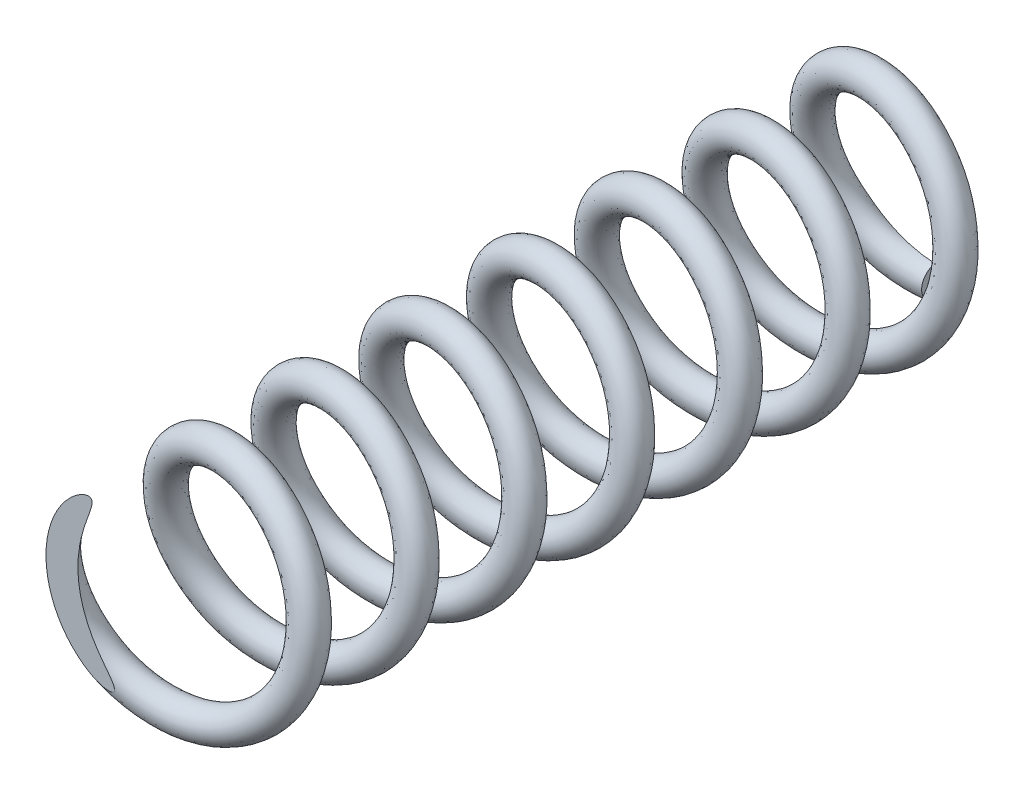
ISO-10303-21;
HEADER;
FILE_DESCRIPTION(('STEP AP214'),'2;1');
FILE_NAME('part.step','',(''),(''),'','','');
FILE_SCHEMA(('AUTOMOTIVE_DESIGN { 1 0 10303 214 1 1 1 1 }'));
ENDSEC;
DATA;
#1=APPLICATION_CONTEXT('core data for automotive mechanical design processes');
#2=APPLICATION_PROTOCOL_DEFINITION('international standard','automotive_design',2000,#1);
#3=PRODUCT_CONTEXT('',#1,'mechanical');
#4=PRODUCT('Part','Part','',(#3));
#5=PRODUCT_RELATED_PRODUCT_CATEGORY('part','',(#4));
#6=PRODUCT_DEFINITION_FORMATION('','',#4);
#7=PRODUCT_DEFINITION_CONTEXT('part definition',#1,'design');
#8=PRODUCT_DEFINITION('design','',#6,#7);
#9=PRODUCT_DEFINITION_SHAPE('','',#8);
#10=(LENGTH_UNIT() NAMED_UNIT(*) SI_UNIT(.MILLI.,.METRE.));
#11=(NAMED_UNIT(*) PLANE_ANGLE_UNIT() SI_UNIT($,.RADIAN.));
#12=(NAMED_UNIT(*) SI_UNIT($,.STERADIAN.) SOLID_ANGLE_UNIT());
#13=UNCERTAINTY_MEASURE_WITH_UNIT(LENGTH_MEASURE(1.E-05),#10,'distance_accuracy_value','');
#14=(GEOMETRIC_REPRESENTATION_CONTEXT(3) GLOBAL_UNCERTAINTY_ASSIGNED_CONTEXT((#13)) GLOBAL_UNIT_ASSIGNED_CONTEXT((#10,
#11,#12)) REPRESENTATION_CONTEXT('',''));
#15=CARTESIAN_POINT('',(0.,0.,0.));
#16=DIRECTION('',(0.,0.,1.));
#17=DIRECTION('',(1.,0.,0.));
#18=AXIS2_PLACEMENT_3D('',#15,#16,#17);
#19=CARTESIAN_POINT('',(1.1003677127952E-12,-9.,-85.));
#20=DIRECTION('',(-1.,-1.22263079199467E-13,0.));
#21=DIRECTION('',(0.,0.,-1.));
#22=AXIS2_PLACEMENT_3D('',#19,#20,#21);
#23=PLANE('',#22);
#24=CARTESIAN_POINT('',(1.1003677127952E-12,-9.,-85.));
#25=DIRECTION('',(-1.,-1.22263079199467E-13,0.));
#26=DIRECTION('',(0.,0.,-1.));
#27=AXIS2_PLACEMENT_3D('',#24,#25,#26);
#28=CIRCLE('',#27,1.5);
#29=CARTESIAN_POINT('',(1.28086227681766E-12,-10.4762802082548,-84.7342995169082));
#30=VERTEX_POINT('',#29);
#31=CARTESIAN_POINT('',(9.19687131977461E-13,-7.5237197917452,-84.7342995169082));
#32=VERTEX_POINT('',#31);
#33=EDGE_CURVE('E44',#30,#32,#28,.T.);
#34=ORIENTED_EDGE('',*,*,#33,.F.);
#35=DIRECTION('',(-1.22263079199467E-13,1.,0.));
#36=VECTOR('',#35,1.);
#37=CARTESIAN_POINT('',(1.1003677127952E-12,-9.,-84.7342995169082));
#38=LINE('',#37,#36);
#39=EDGE_CURVE('E50',#30,#32,#38,.T.);
#40=ORIENTED_EDGE('',*,*,#39,.T.);
#41=EDGE_LOOP('',(#34,#40));
#42=FACE_BOUND('',#41,.T.);
#43=ADVANCED_FACE('F33',(#42),#23,.F.);
#44=CARTESIAN_POINT('',(0.,9.,-1.5));
#45=CARTESIAN_POINT('',(-3.72792206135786,9.,-2.125));
#46=CARTESIAN_POINT('',(-6.36396103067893,6.36396103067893,-2.75));
#47=CARTESIAN_POINT('',(-9.,3.72792206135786,-3.375));
#48=CARTESIAN_POINT('',(-9.,0.,-3.99999999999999));
#49=CARTESIAN_POINT('',(-9.,-3.72792206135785,-4.62499999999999));
#50=CARTESIAN_POINT('',(-6.36396103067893,-6.36396103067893,-5.24999999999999));
#51=CARTESIAN_POINT('',(-3.72792206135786,-9.,-5.87499999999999));
#52=CARTESIAN_POINT('',(0.,-9.,-6.49999999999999));
#53=CARTESIAN_POINT('',(3.72792206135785,-9.,-7.12499999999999));
#54=CARTESIAN_POINT('',(6.36396103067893,-6.36396103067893,-7.74999999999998));
#55=CARTESIAN_POINT('',(9.,-3.72792206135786,-8.37499999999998));
#56=CARTESIAN_POINT('',(9.,0.,-8.99999999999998));
#57=CARTESIAN_POINT('',(9.,3.72792206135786,-9.62499999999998));
#58=CARTESIAN_POINT('',(6.36396103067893,6.36396103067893,-10.25));
#59=CARTESIAN_POINT('',(3.72792206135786,9.,-10.875));
#60=CARTESIAN_POINT('',(0.,9.,-11.5));
#61=CARTESIAN_POINT('',(-3.72792206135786,9.,-12.125));
#62=CARTESIAN_POINT('',(-6.36396103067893,6.36396103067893,-12.75));
#63=CARTESIAN_POINT('',(-9.,3.72792206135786,-13.375));
#64=CARTESIAN_POINT('',(-9.,0.,-14.));
#65=CARTESIAN_POINT('',(-9.,-3.72792206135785,-14.625));
#66=CARTESIAN_POINT('',(-6.36396103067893,-6.36396103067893,-15.25));
#67=CARTESIAN_POINT('',(-3.72792206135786,-9.,-15.875));
#68=CARTESIAN_POINT('',(0.,-9.,-16.5));
#69=CARTESIAN_POINT('',(3.72792206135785,-9.,-17.125));
#70=CARTESIAN_POINT('',(6.36396103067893,-6.36396103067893,-17.75));
#71=CARTESIAN_POINT('',(9.,-3.72792206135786,-18.375));
#72=CARTESIAN_POINT('',(9.,0.,-19.));
#73=CARTESIAN_POINT('',(9.,3.72792206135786,-19.625));
#74=CARTESIAN_POINT('',(6.36396103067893,6.36396103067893,-20.25));
#75=CARTESIAN_POINT('',(3.72792206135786,9.,-20.875));
#76=CARTESIAN_POINT('',(0.,9.,-21.5));
#77=CARTESIAN_POINT('',(-3.72792206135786,9.,-22.1249999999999));
#78=CARTESIAN_POINT('',(-6.36396103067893,6.36396103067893,-22.7499999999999));
#79=CARTESIAN_POINT('',(-9.,3.72792206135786,-23.3749999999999));
#80=CARTESIAN_POINT('',(-9.,0.,-23.9999999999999));
#81=CARTESIAN_POINT('',(-9.,-3.72792206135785,-24.6249999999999));
#82=CARTESIAN_POINT('',(-6.36396103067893,-6.36396103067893,-25.2499999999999));
#83=CARTESIAN_POINT('',(-3.72792206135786,-9.,-25.8749999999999));
#84=CARTESIAN_POINT('',(0.,-9.,-26.4999999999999));
#85=CARTESIAN_POINT('',(3.72792206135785,-9.,-27.1249999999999));
#86=CARTESIAN_POINT('',(6.36396103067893,-6.36396103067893,-27.7499999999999));
#87=CARTESIAN_POINT('',(9.,-3.72792206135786,-28.3749999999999));
#88=CARTESIAN_POINT('',(9.,0.,-28.9999999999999));
#89=CARTESIAN_POINT('',(9.,3.72792206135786,-29.6249999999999));
#90=CARTESIAN_POINT('',(6.36396103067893,6.36396103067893,-30.2499999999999));
#91=CARTESIAN_POINT('',(3.72792206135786,9.,-30.8749999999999));
#92=CARTESIAN_POINT('',(0.,9.,-31.4999999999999));
#93=CARTESIAN_POINT('',(-3.72792206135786,9.,-32.1249999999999));
#94=CARTESIAN_POINT('',(-6.36396103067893,6.36396103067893,-32.7499999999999));
#95=CARTESIAN_POINT('',(-9.,3.72792206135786,-33.3749999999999));
#96=CARTESIAN_POINT('',(-9.,0.,-33.9999999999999));
#97=CARTESIAN_POINT('',(-9.,-3.72792206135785,-34.6249999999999));
#98=CARTESIAN_POINT('',(-6.36396103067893,-6.36396103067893,-35.2499999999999));
#99=CARTESIAN_POINT('',(-3.72792206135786,-9.,-35.8749999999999));
#100=CARTESIAN_POINT('',(0.,-9.,-36.4999999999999));
#101=CARTESIAN_POINT('',(3.72792206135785,-9.,-37.1249999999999));
#102=CARTESIAN_POINT('',(6.36396103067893,-6.36396103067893,-37.7499999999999));
#103=CARTESIAN_POINT('',(9.,-3.72792206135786,-38.3749999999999));
#104=CARTESIAN_POINT('',(9.,0.,-38.9999999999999));
#105=CARTESIAN_POINT('',(9.,3.72792206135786,-39.6249999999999));
#106=CARTESIAN_POINT('',(6.36396103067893,6.36396103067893,-40.2499999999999));
#107=CARTESIAN_POINT('',(3.72792206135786,9.,-40.8749999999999));
#108=CARTESIAN_POINT('',(0.,9.,-41.4999999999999));
#109=CARTESIAN_POINT('',(-3.72792206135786,9.,-42.1249999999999));
#110=CARTESIAN_POINT('',(-6.36396103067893,6.36396103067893,-42.7499999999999));
#111=CARTESIAN_POINT('',(-9.,3.72792206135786,-43.3749999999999));
#112=CARTESIAN_POINT('',(-9.,0.,-43.9999999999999));
#113=CARTESIAN_POINT('',(-9.,-3.72792206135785,-44.6249999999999));
#114=CARTESIAN_POINT('',(-6.36396103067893,-6.36396103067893,-45.2499999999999));
#115=CARTESIAN_POINT('',(-3.72792206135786,-9.,-45.8749999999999));
#116=CARTESIAN_POINT('',(0.,-9.,-46.4999999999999));
#117=CARTESIAN_POINT('',(3.72792206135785,-9.,-47.1249999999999));
#118=CARTESIAN_POINT('',(6.36396103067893,-6.36396103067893,-47.7499999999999));
#119=CARTESIAN_POINT('',(9.,-3.72792206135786,-48.3749999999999));
#120=CARTESIAN_POINT('',(9.,0.,-48.9999999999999));
#121=CARTESIAN_POINT('',(9.,3.72792206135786,-49.6249999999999));
#122=CARTESIAN_POINT('',(6.36396103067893,6.36396103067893,-50.2499999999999));
#123=CARTESIAN_POINT('',(3.72792206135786,9.,-50.8749999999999));
#124=CARTESIAN_POINT('',(0.,9.,-51.4999999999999));
#125=CARTESIAN_POINT('',(-3.72792206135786,9.,-52.1249999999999));
#126=CARTESIAN_POINT('',(-6.36396103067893,6.36396103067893,-52.7499999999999));
#127=CARTESIAN_POINT('',(-9.,3.72792206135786,-53.3749999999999));
#128=CARTESIAN_POINT('',(-9.,0.,-53.9999999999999));
#129=CARTESIAN_POINT('',(-9.,-3.72792206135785,-54.6249999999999));
#130=CARTESIAN_POINT('',(-6.36396103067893,-6.36396103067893,-55.2499999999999));
#131=CARTESIAN_POINT('',(-3.72792206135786,-9.,-55.8749999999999));
#132=CARTESIAN_POINT('',(0.,-9.,-56.4999999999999));
#133=CARTESIAN_POINT('',(3.72792206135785,-9.,-57.1249999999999));
#134=CARTESIAN_POINT('',(6.36396103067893,-6.36396103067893,-57.7499999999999));
#135=CARTESIAN_POINT('',(9.,-3.72792206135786,-58.3749999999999));
#136=CARTESIAN_POINT('',(9.,0.,-58.9999999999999));
#137=CARTESIAN_POINT('',(9.,3.72792206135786,-59.6249999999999));
#138=CARTESIAN_POINT('',(6.36396103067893,6.36396103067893,-60.2499999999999));
#139=CARTESIAN_POINT('',(3.72792206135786,9.,-60.8749999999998));
#140=CARTESIAN_POINT('',(0.,9.,-61.4999999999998));
#141=CARTESIAN_POINT('',(-3.72792206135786,9.,-62.1249999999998));
#142=CARTESIAN_POINT('',(-6.36396103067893,6.36396103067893,-62.7499999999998));
#143=CARTESIAN_POINT('',(-9.,3.72792206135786,-63.3749999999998));
#144=CARTESIAN_POINT('',(-9.,0.,-63.9999999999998));
#145=CARTESIAN_POINT('',(-9.,-3.72792206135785,-64.6249999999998));
#146=CARTESIAN_POINT('',(-6.36396103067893,-6.36396103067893,-65.2499999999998));
#147=CARTESIAN_POINT('',(-3.72792206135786,-9.,-65.8749999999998));
#148=CARTESIAN_POINT('',(0.,-9.,-66.4999999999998));
#149=CARTESIAN_POINT('',(3.72792206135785,-9.,-67.1249999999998));
#150=CARTESIAN_POINT('',(6.36396103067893,-6.36396103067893,-67.7499999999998));
#151=CARTESIAN_POINT('',(9.,-3.72792206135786,-68.3749999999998));
#152=CARTESIAN_POINT('',(9.,0.,-68.9999999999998));
#153=CARTESIAN_POINT('',(9.,3.72792206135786,-69.6249999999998));
#154=CARTESIAN_POINT('',(6.36396103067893,6.36396103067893,-70.2499999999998));
#155=CARTESIAN_POINT('',(3.72792206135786,9.,-70.8749999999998));
#156=CARTESIAN_POINT('',(0.,9.,-71.4999999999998));
#157=CARTESIAN_POINT('',(-3.72792206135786,9.,-72.1249999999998));
#158=CARTESIAN_POINT('',(-6.36396103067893,6.36396103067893,-72.7499999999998));
#159=CARTESIAN_POINT('',(-9.,3.72792206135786,-73.3749999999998));
#160=CARTESIAN_POINT('',(-9.,0.,-73.9999999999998));
#161=CARTESIAN_POINT('',(-9.,-3.72792206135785,-74.6249999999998));
#162=CARTESIAN_POINT('',(-6.36396103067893,-6.36396103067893,-75.2499999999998));
#163=CARTESIAN_POINT('',(-3.72792206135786,-9.,-75.8749999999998));
#164=CARTESIAN_POINT('',(0.,-9.,-76.4999999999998));
#165=CARTESIAN_POINT('',(3.72792206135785,-9.,-77.1249999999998));
#166=CARTESIAN_POINT('',(6.36396103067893,-6.36396103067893,-77.7499999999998));
#167=CARTESIAN_POINT('',(9.,-3.72792206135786,-78.3749999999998));
#168=CARTESIAN_POINT('',(9.,0.,-78.9999999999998));
#169=CARTESIAN_POINT('',(9.,3.72792206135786,-79.6249999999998));
#170=CARTESIAN_POINT('',(6.36396103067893,6.36396103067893,-80.2499999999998));
#171=CARTESIAN_POINT('',(3.72792206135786,9.,-80.8749999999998));
#172=CARTESIAN_POINT('',(0.,9.,-81.4999999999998));
#173=CARTESIAN_POINT('',(-3.72792206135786,9.,-82.1249999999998));
#174=CARTESIAN_POINT('',(-6.36396103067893,6.36396103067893,-82.7499999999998));
#175=CARTESIAN_POINT('',(-9.,3.72792206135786,-83.3749999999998));
#176=CARTESIAN_POINT('',(-9.,0.,-83.9999999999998));
#177=CARTESIAN_POINT('',(-9.,-3.72792206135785,-84.6249999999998));
#178=CARTESIAN_POINT('',(-6.36396103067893,-6.36396103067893,-85.2499999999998));
#179=CARTESIAN_POINT('',(-3.72792206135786,-9.,-85.8749999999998));
#180=CARTESIAN_POINT('',(0.,-9.,-86.4999999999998));
#181=CARTESIAN_POINT('',(3.72792206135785,-9.,-87.1249999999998));
#182=CARTESIAN_POINT('',(6.36396103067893,-6.36396103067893,-87.7499999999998));
#183=CARTESIAN_POINT('',(9.,-3.72792206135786,-88.3749999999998));
#184=CARTESIAN_POINT('',(9.,0.,-88.9999999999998));
#185=CARTESIAN_POINT('',(9.,3.72792206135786,-89.6249999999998));
#186=CARTESIAN_POINT('',(6.36396103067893,6.36396103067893,-90.2499999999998));
#187=CARTESIAN_POINT('',(3.72792206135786,9.,-90.8749999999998));
#188=CARTESIAN_POINT('',(0.,9.,-91.4999999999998));
#189=CARTESIAN_POINT('',(0.,12.,-1.5));
#190=CARTESIAN_POINT('',(-4.97056274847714,12.,-2.125));
#191=CARTESIAN_POINT('',(-8.48528137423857,8.48528137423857,-2.75));
#192=CARTESIAN_POINT('',(-12.,4.97056274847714,-3.375));
#193=CARTESIAN_POINT('',(-12.,0.,-3.99999999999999));
#194=CARTESIAN_POINT('',(-12.,-4.97056274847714,-4.62499999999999));
#195=CARTESIAN_POINT('',(-8.48528137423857,-8.48528137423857,-5.24999999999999));
#196=CARTESIAN_POINT('',(-4.97056274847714,-12.,-5.87499999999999));
#197=CARTESIAN_POINT('',(0.,-12.,-6.49999999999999));
#198=CARTESIAN_POINT('',(4.97056274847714,-12.,-7.12499999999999));
#199=CARTESIAN_POINT('',(8.48528137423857,-8.48528137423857,-7.74999999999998));
#200=CARTESIAN_POINT('',(12.,-4.97056274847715,-8.37499999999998));
#201=CARTESIAN_POINT('',(12.,0.,-8.99999999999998));
#202=CARTESIAN_POINT('',(12.,4.97056274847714,-9.62499999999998));
#203=CARTESIAN_POINT('',(8.48528137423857,8.48528137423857,-10.25));
#204=CARTESIAN_POINT('',(4.97056274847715,12.,-10.875));
#205=CARTESIAN_POINT('',(0.,12.,-11.5));
#206=CARTESIAN_POINT('',(-4.97056274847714,12.,-12.125));
#207=CARTESIAN_POINT('',(-8.48528137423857,8.48528137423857,-12.75));
#208=CARTESIAN_POINT('',(-12.,4.97056274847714,-13.375));
#209=CARTESIAN_POINT('',(-12.,0.,-14.));
#210=CARTESIAN_POINT('',(-12.,-4.97056274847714,-14.625));
#211=CARTESIAN_POINT('',(-8.48528137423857,-8.48528137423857,-15.25));
#212=CARTESIAN_POINT('',(-4.97056274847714,-12.,-15.875));
#213=CARTESIAN_POINT('',(0.,-12.,-16.5));
#214=CARTESIAN_POINT('',(4.97056274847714,-12.,-17.125));
#215=CARTESIAN_POINT('',(8.48528137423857,-8.48528137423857,-17.75));
#216=CARTESIAN_POINT('',(12.,-4.97056274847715,-18.375));
#217=CARTESIAN_POINT('',(12.,0.,-19.));
#218=CARTESIAN_POINT('',(12.,4.97056274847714,-19.625));
#219=CARTESIAN_POINT('',(8.48528137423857,8.48528137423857,-20.25));
#220=CARTESIAN_POINT('',(4.97056274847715,12.,-20.875));
#221=CARTESIAN_POINT('',(0.,12.,-21.5));
#222=CARTESIAN_POINT('',(-4.97056274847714,12.,-22.1249999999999));
#223=CARTESIAN_POINT('',(-8.48528137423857,8.48528137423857,-22.7499999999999));
#224=CARTESIAN_POINT('',(-12.,4.97056274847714,-23.3749999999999));
#225=CARTESIAN_POINT('',(-12.,0.,-23.9999999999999));
#226=CARTESIAN_POINT('',(-12.,-4.97056274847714,-24.6249999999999));
#227=CARTESIAN_POINT('',(-8.48528137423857,-8.48528137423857,-25.2499999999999));
#228=CARTESIAN_POINT('',(-4.97056274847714,-12.,-25.8749999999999));
#229=CARTESIAN_POINT('',(0.,-12.,-26.4999999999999));
#230=CARTESIAN_POINT('',(4.97056274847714,-12.,-27.1249999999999));
#231=CARTESIAN_POINT('',(8.48528137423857,-8.48528137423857,-27.7499999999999));
#232=CARTESIAN_POINT('',(12.,-4.97056274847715,-28.3749999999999));
#233=CARTESIAN_POINT('',(12.,0.,-28.9999999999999));
#234=CARTESIAN_POINT('',(12.,4.97056274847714,-29.6249999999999));
#235=CARTESIAN_POINT('',(8.48528137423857,8.48528137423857,-30.2499999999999));
#236=CARTESIAN_POINT('',(4.97056274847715,12.,-30.8749999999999));
#237=CARTESIAN_POINT('',(0.,12.,-31.4999999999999));
#238=CARTESIAN_POINT('',(-4.97056274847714,12.,-32.1249999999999));
#239=CARTESIAN_POINT('',(-8.48528137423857,8.48528137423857,-32.7499999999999));
#240=CARTESIAN_POINT('',(-12.,4.97056274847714,-33.3749999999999));
#241=CARTESIAN_POINT('',(-12.,0.,-33.9999999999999));
#242=CARTESIAN_POINT('',(-12.,-4.97056274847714,-34.6249999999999));
#243=CARTESIAN_POINT('',(-8.48528137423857,-8.48528137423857,-35.2499999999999));
#244=CARTESIAN_POINT('',(-4.97056274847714,-12.,-35.8749999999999));
#245=CARTESIAN_POINT('',(0.,-12.,-36.4999999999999));
#246=CARTESIAN_POINT('',(4.97056274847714,-12.,-37.1249999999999));
#247=CARTESIAN_POINT('',(8.48528137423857,-8.48528137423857,-37.7499999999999));
#248=CARTESIAN_POINT('',(12.,-4.97056274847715,-38.3749999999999));
#249=CARTESIAN_POINT('',(12.,0.,-38.9999999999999));
#250=CARTESIAN_POINT('',(12.,4.97056274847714,-39.6249999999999));
#251=CARTESIAN_POINT('',(8.48528137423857,8.48528137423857,-40.2499999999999));
#252=CARTESIAN_POINT('',(4.97056274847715,12.,-40.8749999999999));
#253=CARTESIAN_POINT('',(0.,12.,-41.4999999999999));
#254=CARTESIAN_POINT('',(-4.97056274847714,12.,-42.1249999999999));
#255=CARTESIAN_POINT('',(-8.48528137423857,8.48528137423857,-42.7499999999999));
#256=CARTESIAN_POINT('',(-12.,4.97056274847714,-43.3749999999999));
#257=CARTESIAN_POINT('',(-12.,0.,-43.9999999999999));
#258=CARTESIAN_POINT('',(-12.,-4.97056274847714,-44.6249999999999));
#259=CARTESIAN_POINT('',(-8.48528137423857,-8.48528137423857,-45.2499999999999));
#260=CARTESIAN_POINT('',(-4.97056274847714,-12.,-45.8749999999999));
#261=CARTESIAN_POINT('',(0.,-12.,-46.4999999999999));
#262=CARTESIAN_POINT('',(4.97056274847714,-12.,-47.1249999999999));
#263=CARTESIAN_POINT('',(8.48528137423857,-8.48528137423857,-47.7499999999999));
#264=CARTESIAN_POINT('',(12.,-4.97056274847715,-48.3749999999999));
#265=CARTESIAN_POINT('',(12.,0.,-48.9999999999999));
#266=CARTESIAN_POINT('',(12.,4.97056274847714,-49.6249999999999));
#267=CARTESIAN_POINT('',(8.48528137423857,8.48528137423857,-50.2499999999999));
#268=CARTESIAN_POINT('',(4.97056274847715,12.,-50.8749999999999));
#269=CARTESIAN_POINT('',(0.,12.,-51.4999999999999));
#270=CARTESIAN_POINT('',(-4.97056274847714,12.,-52.1249999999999));
#271=CARTESIAN_POINT('',(-8.48528137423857,8.48528137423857,-52.7499999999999));
#272=CARTESIAN_POINT('',(-12.,4.97056274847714,-53.3749999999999));
#273=CARTESIAN_POINT('',(-12.,0.,-53.9999999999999));
#274=CARTESIAN_POINT('',(-12.,-4.97056274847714,-54.6249999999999));
#275=CARTESIAN_POINT('',(-8.48528137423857,-8.48528137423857,-55.2499999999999));
#276=CARTESIAN_POINT('',(-4.97056274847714,-12.,-55.8749999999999));
#277=CARTESIAN_POINT('',(0.,-12.,-56.4999999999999));
#278=CARTESIAN_POINT('',(4.97056274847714,-12.,-57.1249999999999));
#279=CARTESIAN_POINT('',(8.48528137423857,-8.48528137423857,-57.7499999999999));
#280=CARTESIAN_POINT('',(12.,-4.97056274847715,-58.3749999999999));
#281=CARTESIAN_POINT('',(12.,0.,-58.9999999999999));
#282=CARTESIAN_POINT('',(12.,4.97056274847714,-59.6249999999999));
#283=CARTESIAN_POINT('',(8.48528137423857,8.48528137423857,-60.2499999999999));
#284=CARTESIAN_POINT('',(4.97056274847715,12.,-60.8749999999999));
#285=CARTESIAN_POINT('',(0.,12.,-61.4999999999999));
#286=CARTESIAN_POINT('',(-4.97056274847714,12.,-62.1249999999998));
#287=CARTESIAN_POINT('',(-8.48528137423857,8.48528137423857,-62.7499999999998));
#288=CARTESIAN_POINT('',(-12.,4.97056274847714,-63.3749999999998));
#289=CARTESIAN_POINT('',(-12.,0.,-63.9999999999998));
#290=CARTESIAN_POINT('',(-12.,-4.97056274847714,-64.6249999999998));
#291=CARTESIAN_POINT('',(-8.48528137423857,-8.48528137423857,-65.2499999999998));
#292=CARTESIAN_POINT('',(-4.97056274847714,-12.,-65.8749999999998));
#293=CARTESIAN_POINT('',(0.,-12.,-66.4999999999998));
#294=CARTESIAN_POINT('',(4.97056274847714,-12.,-67.1249999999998));
#295=CARTESIAN_POINT('',(8.48528137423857,-8.48528137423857,-67.7499999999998));
#296=CARTESIAN_POINT('',(12.,-4.97056274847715,-68.3749999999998));
#297=CARTESIAN_POINT('',(12.,0.,-68.9999999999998));
#298=CARTESIAN_POINT('',(12.,4.97056274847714,-69.6249999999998));
#299=CARTESIAN_POINT('',(8.48528137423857,8.48528137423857,-70.2499999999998));
#300=CARTESIAN_POINT('',(4.97056274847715,12.,-70.8749999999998));
#301=CARTESIAN_POINT('',(0.,12.,-71.4999999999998));
#302=CARTESIAN_POINT('',(-4.97056274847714,12.,-72.1249999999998));
#303=CARTESIAN_POINT('',(-8.48528137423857,8.48528137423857,-72.7499999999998));
#304=CARTESIAN_POINT('',(-12.,4.97056274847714,-73.3749999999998));
#305=CARTESIAN_POINT('',(-12.,0.,-73.9999999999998));
#306=CARTESIAN_POINT('',(-12.,-4.97056274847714,-74.6249999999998));
#307=CARTESIAN_POINT('',(-8.48528137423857,-8.48528137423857,-75.2499999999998));
#308=CARTESIAN_POINT('',(-4.97056274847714,-12.,-75.8749999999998));
#309=CARTESIAN_POINT('',(0.,-12.,-76.4999999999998));
#310=CARTESIAN_POINT('',(4.97056274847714,-12.,-77.1249999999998));
#311=CARTESIAN_POINT('',(8.48528137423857,-8.48528137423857,-77.7499999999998));
#312=CARTESIAN_POINT('',(12.,-4.97056274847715,-78.3749999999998));
#313=CARTESIAN_POINT('',(12.,0.,-78.9999999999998));
#314=CARTESIAN_POINT('',(12.,4.97056274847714,-79.6249999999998));
#315=CARTESIAN_POINT('',(8.48528137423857,8.48528137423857,-80.2499999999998));
#316=CARTESIAN_POINT('',(4.97056274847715,12.,-80.8749999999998));
#317=CARTESIAN_POINT('',(0.,12.,-81.4999999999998));
#318=CARTESIAN_POINT('',(-4.97056274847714,12.,-82.1249999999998));
#319=CARTESIAN_POINT('',(-8.48528137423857,8.48528137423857,-82.7499999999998));
#320=CARTESIAN_POINT('',(-12.,4.97056274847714,-83.3749999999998));
#321=CARTESIAN_POINT('',(-12.,0.,-83.9999999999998));
#322=CARTESIAN_POINT('',(-12.,-4.97056274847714,-84.6249999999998));
#323=CARTESIAN_POINT('',(-8.48528137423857,-8.48528137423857,-85.2499999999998));
#324=CARTESIAN_POINT('',(-4.97056274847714,-12.,-85.8749999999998));
#325=CARTESIAN_POINT('',(0.,-12.,-86.4999999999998));
#326=CARTESIAN_POINT('',(4.97056274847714,-12.,-87.1249999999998));
#327=CARTESIAN_POINT('',(8.48528137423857,-8.48528137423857,-87.7499999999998));
#328=CARTESIAN_POINT('',(12.,-4.97056274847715,-88.3749999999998));
#329=CARTESIAN_POINT('',(12.,0.,-88.9999999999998));
#330=CARTESIAN_POINT('',(12.,4.97056274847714,-89.6249999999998));
#331=CARTESIAN_POINT('',(8.48528137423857,8.48528137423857,-90.2499999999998));
#332=CARTESIAN_POINT('',(4.97056274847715,12.,-90.8749999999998));
#333=CARTESIAN_POINT('',(0.,12.,-91.4999999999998));
#334=CARTESIAN_POINT('',(0.,12.,1.5));
#335=CARTESIAN_POINT('',(-4.97056274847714,12.,0.875000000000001));
#336=CARTESIAN_POINT('',(-8.48528137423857,8.48528137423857,0.250000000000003));
#337=CARTESIAN_POINT('',(-12.,4.97056274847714,-0.374999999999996));
#338=CARTESIAN_POINT('',(-12.,0.,-0.999999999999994));
#339=CARTESIAN_POINT('',(-12.,-4.97056274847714,-1.62499999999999));
#340=CARTESIAN_POINT('',(-8.48528137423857,-8.48528137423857,-2.24999999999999));
#341=CARTESIAN_POINT('',(-4.97056274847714,-12.,-2.87499999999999));
#342=CARTESIAN_POINT('',(0.,-12.,-3.49999999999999));
#343=CARTESIAN_POINT('',(4.97056274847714,-12.,-4.12499999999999));
#344=CARTESIAN_POINT('',(8.48528137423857,-8.48528137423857,-4.74999999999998));
#345=CARTESIAN_POINT('',(12.,-4.97056274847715,-5.37499999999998));
#346=CARTESIAN_POINT('',(12.,0.,-5.99999999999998));
#347=CARTESIAN_POINT('',(12.,4.97056274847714,-6.62499999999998));
#348=CARTESIAN_POINT('',(8.48528137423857,8.48528137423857,-7.24999999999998));
#349=CARTESIAN_POINT('',(4.97056274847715,12.,-7.87499999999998));
#350=CARTESIAN_POINT('',(0.,12.,-8.49999999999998));
#351=CARTESIAN_POINT('',(-4.97056274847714,12.,-9.12499999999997));
#352=CARTESIAN_POINT('',(-8.48528137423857,8.48528137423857,-9.74999999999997));
#353=CARTESIAN_POINT('',(-12.,4.97056274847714,-10.375));
#354=CARTESIAN_POINT('',(-12.,0.,-11.));
#355=CARTESIAN_POINT('',(-12.,-4.97056274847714,-11.625));
#356=CARTESIAN_POINT('',(-8.48528137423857,-8.48528137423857,-12.25));
#357=CARTESIAN_POINT('',(-4.97056274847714,-12.,-12.875));
#358=CARTESIAN_POINT('',(0.,-12.,-13.5));
#359=CARTESIAN_POINT('',(4.97056274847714,-12.,-14.125));
#360=CARTESIAN_POINT('',(8.48528137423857,-8.48528137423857,-14.75));
#361=CARTESIAN_POINT('',(12.,-4.97056274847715,-15.375));
#362=CARTESIAN_POINT('',(12.,0.,-16.));
#363=CARTESIAN_POINT('',(12.,4.97056274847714,-16.625));
#364=CARTESIAN_POINT('',(8.48528137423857,8.48528137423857,-17.25));
#365=CARTESIAN_POINT('',(4.97056274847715,12.,-17.875));
#366=CARTESIAN_POINT('',(0.,12.,-18.4999999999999));
#367=CARTESIAN_POINT('',(-4.97056274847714,12.,-19.1249999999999));
#368=CARTESIAN_POINT('',(-8.48528137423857,8.48528137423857,-19.7499999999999));
#369=CARTESIAN_POINT('',(-12.,4.97056274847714,-20.3749999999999));
#370=CARTESIAN_POINT('',(-12.,0.,-20.9999999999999));
#371=CARTESIAN_POINT('',(-12.,-4.97056274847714,-21.6249999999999));
#372=CARTESIAN_POINT('',(-8.48528137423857,-8.48528137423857,-22.2499999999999));
#373=CARTESIAN_POINT('',(-4.97056274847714,-12.,-22.8749999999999));
#374=CARTESIAN_POINT('',(0.,-12.,-23.4999999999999));
#375=CARTESIAN_POINT('',(4.97056274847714,-12.,-24.1249999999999));
#376=CARTESIAN_POINT('',(8.48528137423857,-8.48528137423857,-24.7499999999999));
#377=CARTESIAN_POINT('',(12.,-4.97056274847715,-25.3749999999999));
#378=CARTESIAN_POINT('',(12.,0.,-25.9999999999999));
#379=CARTESIAN_POINT('',(12.,4.97056274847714,-26.6249999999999));
#380=CARTESIAN_POINT('',(8.48528137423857,8.48528137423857,-27.2499999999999));
#381=CARTESIAN_POINT('',(4.97056274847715,12.,-27.8749999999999));
#382=CARTESIAN_POINT('',(0.,12.,-28.4999999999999));
#383=CARTESIAN_POINT('',(-4.97056274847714,12.,-29.1249999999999));
#384=CARTESIAN_POINT('',(-8.48528137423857,8.48528137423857,-29.7499999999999));
#385=CARTESIAN_POINT('',(-12.,4.97056274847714,-30.3749999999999));
#386=CARTESIAN_POINT('',(-12.,0.,-30.9999999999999));
#387=CARTESIAN_POINT('',(-12.,-4.97056274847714,-31.6249999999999));
#388=CARTESIAN_POINT('',(-8.48528137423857,-8.48528137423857,-32.2499999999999));
#389=CARTESIAN_POINT('',(-4.97056274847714,-12.,-32.8749999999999));
#390=CARTESIAN_POINT('',(0.,-12.,-33.4999999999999));
#391=CARTESIAN_POINT('',(4.97056274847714,-12.,-34.1249999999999));
#392=CARTESIAN_POINT('',(8.48528137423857,-8.48528137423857,-34.7499999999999));
#393=CARTESIAN_POINT('',(12.,-4.97056274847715,-35.3749999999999));
#394=CARTESIAN_POINT('',(12.,0.,-35.9999999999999));
#395=CARTESIAN_POINT('',(12.,4.97056274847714,-36.6249999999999));
#396=CARTESIAN_POINT('',(8.48528137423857,8.48528137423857,-37.2499999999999));
#397=CARTESIAN_POINT('',(4.97056274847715,12.,-37.8749999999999));
#398=CARTESIAN_POINT('',(0.,12.,-38.4999999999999));
#399=CARTESIAN_POINT('',(-4.97056274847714,12.,-39.1249999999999));
#400=CARTESIAN_POINT('',(-8.48528137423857,8.48528137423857,-39.7499999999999));
#401=CARTESIAN_POINT('',(-12.,4.97056274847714,-40.3749999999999));
#402=CARTESIAN_POINT('',(-12.,0.,-40.9999999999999));
#403=CARTESIAN_POINT('',(-12.,-4.97056274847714,-41.6249999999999));
#404=CARTESIAN_POINT('',(-8.48528137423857,-8.48528137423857,-42.2499999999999));
#405=CARTESIAN_POINT('',(-4.97056274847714,-12.,-42.8749999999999));
#406=CARTESIAN_POINT('',(0.,-12.,-43.4999999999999));
#407=CARTESIAN_POINT('',(4.97056274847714,-12.,-44.1249999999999));
#408=CARTESIAN_POINT('',(8.48528137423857,-8.48528137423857,-44.7499999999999));
#409=CARTESIAN_POINT('',(12.,-4.97056274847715,-45.3749999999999));
#410=CARTESIAN_POINT('',(12.,0.,-45.9999999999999));
#411=CARTESIAN_POINT('',(12.,4.97056274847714,-46.6249999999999));
#412=CARTESIAN_POINT('',(8.48528137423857,8.48528137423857,-47.2499999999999));
#413=CARTESIAN_POINT('',(4.97056274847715,12.,-47.8749999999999));
#414=CARTESIAN_POINT('',(0.,12.,-48.4999999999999));
#415=CARTESIAN_POINT('',(-4.97056274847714,12.,-49.1249999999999));
#416=CARTESIAN_POINT('',(-8.48528137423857,8.48528137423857,-49.7499999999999));
#417=CARTESIAN_POINT('',(-12.,4.97056274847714,-50.3749999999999));
#418=CARTESIAN_POINT('',(-12.,0.,-50.9999999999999));
#419=CARTESIAN_POINT('',(-12.,-4.97056274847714,-51.6249999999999));
#420=CARTESIAN_POINT('',(-8.48528137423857,-8.48528137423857,-52.2499999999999));
#421=CARTESIAN_POINT('',(-4.97056274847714,-12.,-52.8749999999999));
#422=CARTESIAN_POINT('',(0.,-12.,-53.4999999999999));
#423=CARTESIAN_POINT('',(4.97056274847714,-12.,-54.1249999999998));
#424=CARTESIAN_POINT('',(8.48528137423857,-8.48528137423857,-54.7499999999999));
#425=CARTESIAN_POINT('',(12.,-4.97056274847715,-55.3749999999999));
#426=CARTESIAN_POINT('',(12.,0.,-55.9999999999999));
#427=CARTESIAN_POINT('',(12.,4.97056274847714,-56.6249999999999));
#428=CARTESIAN_POINT('',(8.48528137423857,8.48528137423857,-57.2499999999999));
#429=CARTESIAN_POINT('',(4.97056274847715,12.,-57.8749999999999));
#430=CARTESIAN_POINT('',(0.,12.,-58.4999999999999));
#431=CARTESIAN_POINT('',(-4.97056274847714,12.,-59.1249999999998));
#432=CARTESIAN_POINT('',(-8.48528137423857,8.48528137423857,-59.7499999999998));
#433=CARTESIAN_POINT('',(-12.,4.97056274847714,-60.3749999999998));
#434=CARTESIAN_POINT('',(-12.,0.,-60.9999999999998));
#435=CARTESIAN_POINT('',(-12.,-4.97056274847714,-61.6249999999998));
#436=CARTESIAN_POINT('',(-8.48528137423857,-8.48528137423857,-62.2499999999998));
#437=CARTESIAN_POINT('',(-4.97056274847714,-12.,-62.8749999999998));
#438=CARTESIAN_POINT('',(0.,-12.,-63.4999999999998));
#439=CARTESIAN_POINT('',(4.97056274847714,-12.,-64.1249999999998));
#440=CARTESIAN_POINT('',(8.48528137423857,-8.48528137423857,-64.7499999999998));
#441=CARTESIAN_POINT('',(12.,-4.97056274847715,-65.3749999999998));
#442=CARTESIAN_POINT('',(12.,0.,-65.9999999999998));
#443=CARTESIAN_POINT('',(12.,4.97056274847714,-66.6249999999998));
#444=CARTESIAN_POINT('',(8.48528137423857,8.48528137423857,-67.2499999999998));
#445=CARTESIAN_POINT('',(4.97056274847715,12.,-67.8749999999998));
#446=CARTESIAN_POINT('',(0.,12.,-68.4999999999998));
#447=CARTESIAN_POINT('',(-4.97056274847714,12.,-69.1249999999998));
#448=CARTESIAN_POINT('',(-8.48528137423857,8.48528137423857,-69.7499999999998));
#449=CARTESIAN_POINT('',(-12.,4.97056274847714,-70.3749999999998));
#450=CARTESIAN_POINT('',(-12.,0.,-70.9999999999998));
#451=CARTESIAN_POINT('',(-12.,-4.97056274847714,-71.6249999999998));
#452=CARTESIAN_POINT('',(-8.48528137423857,-8.48528137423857,-72.2499999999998));
#453=CARTESIAN_POINT('',(-4.97056274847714,-12.,-72.8749999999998));
#454=CARTESIAN_POINT('',(0.,-12.,-73.4999999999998));
#455=CARTESIAN_POINT('',(4.97056274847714,-12.,-74.1249999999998));
#456=CARTESIAN_POINT('',(8.48528137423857,-8.48528137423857,-74.7499999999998));
#457=CARTESIAN_POINT('',(12.,-4.97056274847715,-75.3749999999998));
#458=CARTESIAN_POINT('',(12.,0.,-75.9999999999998));
#459=CARTESIAN_POINT('',(12.,4.97056274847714,-76.6249999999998));
#460=CARTESIAN_POINT('',(8.48528137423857,8.48528137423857,-77.2499999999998));
#461=CARTESIAN_POINT('',(4.97056274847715,12.,-77.8749999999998));
#462=CARTESIAN_POINT('',(0.,12.,-78.4999999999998));
#463=CARTESIAN_POINT('',(-4.97056274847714,12.,-79.1249999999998));
#464=CARTESIAN_POINT('',(-8.48528137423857,8.48528137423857,-79.7499999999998));
#465=CARTESIAN_POINT('',(-12.,4.97056274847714,-80.3749999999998));
#466=CARTESIAN_POINT('',(-12.,0.,-80.9999999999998));
#467=CARTESIAN_POINT('',(-12.,-4.97056274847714,-81.6249999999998));
#468=CARTESIAN_POINT('',(-8.48528137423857,-8.48528137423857,-82.2499999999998));
#469=CARTESIAN_POINT('',(-4.97056274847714,-12.,-82.8749999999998));
#470=CARTESIAN_POINT('',(0.,-12.,-83.4999999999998));
#471=CARTESIAN_POINT('',(4.97056274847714,-12.,-84.1249999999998));
#472=CARTESIAN_POINT('',(8.48528137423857,-8.48528137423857,-84.7499999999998));
#473=CARTESIAN_POINT('',(12.,-4.97056274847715,-85.3749999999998));
#474=CARTESIAN_POINT('',(12.,0.,-85.9999999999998));
#475=CARTESIAN_POINT('',(12.,4.97056274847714,-86.6249999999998));
#476=CARTESIAN_POINT('',(8.48528137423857,8.48528137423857,-87.2499999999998));
#477=CARTESIAN_POINT('',(4.97056274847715,12.,-87.8749999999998));
#478=CARTESIAN_POINT('',(0.,12.,-88.4999999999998));
#479=CARTESIAN_POINT('',(0.,9.,1.5));
#480=CARTESIAN_POINT('',(-3.72792206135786,9.,0.875000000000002));
#481=CARTESIAN_POINT('',(-6.36396103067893,6.36396103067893,0.250000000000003));
#482=CARTESIAN_POINT('',(-9.,3.72792206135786,-0.374999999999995));
#483=CARTESIAN_POINT('',(-9.,0.,-0.999999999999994));
#484=CARTESIAN_POINT('',(-9.,-3.72792206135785,-1.62499999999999));
#485=CARTESIAN_POINT('',(-6.36396103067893,-6.36396103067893,-2.24999999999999));
#486=CARTESIAN_POINT('',(-3.72792206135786,-9.,-2.87499999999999));
#487=CARTESIAN_POINT('',(0.,-9.,-3.49999999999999));
#488=CARTESIAN_POINT('',(3.72792206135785,-9.,-4.12499999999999));
#489=CARTESIAN_POINT('',(6.36396103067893,-6.36396103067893,-4.74999999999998));
#490=CARTESIAN_POINT('',(9.,-3.72792206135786,-5.37499999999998));
#491=CARTESIAN_POINT('',(9.,0.,-5.99999999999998));
#492=CARTESIAN_POINT('',(9.,3.72792206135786,-6.62499999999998));
#493=CARTESIAN_POINT('',(6.36396103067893,6.36396103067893,-7.24999999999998));
#494=CARTESIAN_POINT('',(3.72792206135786,9.,-7.87499999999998));
#495=CARTESIAN_POINT('',(0.,9.,-8.49999999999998));
#496=CARTESIAN_POINT('',(-3.72792206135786,9.,-9.12499999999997));
#497=CARTESIAN_POINT('',(-6.36396103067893,6.36396103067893,-9.74999999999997));
#498=CARTESIAN_POINT('',(-9.,3.72792206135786,-10.375));
#499=CARTESIAN_POINT('',(-9.,0.,-11.));
#500=CARTESIAN_POINT('',(-9.,-3.72792206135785,-11.625));
#501=CARTESIAN_POINT('',(-6.36396103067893,-6.36396103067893,-12.25));
#502=CARTESIAN_POINT('',(-3.72792206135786,-9.,-12.875));
#503=CARTESIAN_POINT('',(0.,-9.,-13.5));
#504=CARTESIAN_POINT('',(3.72792206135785,-9.,-14.125));
#505=CARTESIAN_POINT('',(6.36396103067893,-6.36396103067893,-14.75));
#506=CARTESIAN_POINT('',(9.,-3.72792206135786,-15.375));
#507=CARTESIAN_POINT('',(9.,0.,-16.));
#508=CARTESIAN_POINT('',(9.,3.72792206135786,-16.625));
#509=CARTESIAN_POINT('',(6.36396103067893,6.36396103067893,-17.25));
#510=CARTESIAN_POINT('',(3.72792206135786,9.,-17.875));
#511=CARTESIAN_POINT('',(0.,9.,-18.4999999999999));
#512=CARTESIAN_POINT('',(-3.72792206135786,9.,-19.1249999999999));
#513=CARTESIAN_POINT('',(-6.36396103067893,6.36396103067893,-19.7499999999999));
#514=CARTESIAN_POINT('',(-9.,3.72792206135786,-20.3749999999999));
#515=CARTESIAN_POINT('',(-9.,0.,-20.9999999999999));
#516=CARTESIAN_POINT('',(-9.,-3.72792206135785,-21.6249999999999));
#517=CARTESIAN_POINT('',(-6.36396103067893,-6.36396103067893,-22.2499999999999));
#518=CARTESIAN_POINT('',(-3.72792206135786,-9.,-22.8749999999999));
#519=CARTESIAN_POINT('',(0.,-9.,-23.4999999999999));
#520=CARTESIAN_POINT('',(3.72792206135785,-9.,-24.1249999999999));
#521=CARTESIAN_POINT('',(6.36396103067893,-6.36396103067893,-24.7499999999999));
#522=CARTESIAN_POINT('',(9.,-3.72792206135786,-25.3749999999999));
#523=CARTESIAN_POINT('',(9.,0.,-25.9999999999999));
#524=CARTESIAN_POINT('',(9.,3.72792206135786,-26.6249999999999));
#525=CARTESIAN_POINT('',(6.36396103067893,6.36396103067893,-27.2499999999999));
#526=CARTESIAN_POINT('',(3.72792206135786,9.,-27.8749999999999));
#527=CARTESIAN_POINT('',(0.,9.,-28.4999999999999));
#528=CARTESIAN_POINT('',(-3.72792206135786,9.,-29.1249999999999));
#529=CARTESIAN_POINT('',(-6.36396103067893,6.36396103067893,-29.7499999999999));
#530=CARTESIAN_POINT('',(-9.,3.72792206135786,-30.3749999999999));
#531=CARTESIAN_POINT('',(-9.,0.,-30.9999999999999));
#532=CARTESIAN_POINT('',(-9.,-3.72792206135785,-31.6249999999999));
#533=CARTESIAN_POINT('',(-6.36396103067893,-6.36396103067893,-32.2499999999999));
#534=CARTESIAN_POINT('',(-3.72792206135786,-9.,-32.8749999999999));
#535=CARTESIAN_POINT('',(0.,-9.,-33.4999999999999));
#536=CARTESIAN_POINT('',(3.72792206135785,-9.,-34.1249999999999));
#537=CARTESIAN_POINT('',(6.36396103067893,-6.36396103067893,-34.7499999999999));
#538=CARTESIAN_POINT('',(9.,-3.72792206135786,-35.3749999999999));
#539=CARTESIAN_POINT('',(9.,0.,-35.9999999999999));
#540=CARTESIAN_POINT('',(9.,3.72792206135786,-36.6249999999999));
#541=CARTESIAN_POINT('',(6.36396103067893,6.36396103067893,-37.2499999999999));
#542=CARTESIAN_POINT('',(3.72792206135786,9.,-37.8749999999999));
#543=CARTESIAN_POINT('',(0.,9.,-38.4999999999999));
#544=CARTESIAN_POINT('',(-3.72792206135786,9.,-39.1249999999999));
#545=CARTESIAN_POINT('',(-6.36396103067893,6.36396103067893,-39.7499999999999));
#546=CARTESIAN_POINT('',(-9.,3.72792206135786,-40.3749999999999));
#547=CARTESIAN_POINT('',(-9.,0.,-40.9999999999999));
#548=CARTESIAN_POINT('',(-9.,-3.72792206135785,-41.6249999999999));
#549=CARTESIAN_POINT('',(-6.36396103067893,-6.36396103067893,-42.2499999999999));
#550=CARTESIAN_POINT('',(-3.72792206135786,-9.,-42.8749999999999));
#551=CARTESIAN_POINT('',(0.,-9.,-43.4999999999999));
#552=CARTESIAN_POINT('',(3.72792206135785,-9.,-44.1249999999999));
#553=CARTESIAN_POINT('',(6.36396103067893,-6.36396103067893,-44.7499999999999));
#554=CARTESIAN_POINT('',(9.,-3.72792206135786,-45.3749999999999));
#555=CARTESIAN_POINT('',(9.,0.,-45.9999999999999));
#556=CARTESIAN_POINT('',(9.,3.72792206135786,-46.6249999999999));
#557=CARTESIAN_POINT('',(6.36396103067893,6.36396103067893,-47.2499999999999));
#558=CARTESIAN_POINT('',(3.72792206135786,9.,-47.8749999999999));
#559=CARTESIAN_POINT('',(0.,9.,-48.4999999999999));
#560=CARTESIAN_POINT('',(-3.72792206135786,9.,-49.1249999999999));
#561=CARTESIAN_POINT('',(-6.36396103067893,6.36396103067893,-49.7499999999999));
#562=CARTESIAN_POINT('',(-9.,3.72792206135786,-50.3749999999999));
#563=CARTESIAN_POINT('',(-9.,0.,-50.9999999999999));
#564=CARTESIAN_POINT('',(-9.,-3.72792206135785,-51.6249999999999));
#565=CARTESIAN_POINT('',(-6.36396103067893,-6.36396103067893,-52.2499999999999));
#566=CARTESIAN_POINT('',(-3.72792206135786,-9.,-52.8749999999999));
#567=CARTESIAN_POINT('',(0.,-9.,-53.4999999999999));
#568=CARTESIAN_POINT('',(3.72792206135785,-9.,-54.1249999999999));
#569=CARTESIAN_POINT('',(6.36396103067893,-6.36396103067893,-54.7499999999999));
#570=CARTESIAN_POINT('',(9.,-3.72792206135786,-55.3749999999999));
#571=CARTESIAN_POINT('',(9.,0.,-55.9999999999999));
#572=CARTESIAN_POINT('',(9.,3.72792206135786,-56.6249999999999));
#573=CARTESIAN_POINT('',(6.36396103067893,6.36396103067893,-57.2499999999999));
#574=CARTESIAN_POINT('',(3.72792206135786,9.,-57.8749999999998));
#575=CARTESIAN_POINT('',(0.,9.,-58.4999999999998));
#576=CARTESIAN_POINT('',(-3.72792206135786,9.,-59.1249999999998));
#577=CARTESIAN_POINT('',(-6.36396103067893,6.36396103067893,-59.7499999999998));
#578=CARTESIAN_POINT('',(-9.,3.72792206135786,-60.3749999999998));
#579=CARTESIAN_POINT('',(-9.,0.,-60.9999999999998));
#580=CARTESIAN_POINT('',(-9.,-3.72792206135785,-61.6249999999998));
#581=CARTESIAN_POINT('',(-6.36396103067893,-6.36396103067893,-62.2499999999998));
#582=CARTESIAN_POINT('',(-3.72792206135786,-9.,-62.8749999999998));
#583=CARTESIAN_POINT('',(0.,-9.,-63.4999999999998));
#584=CARTESIAN_POINT('',(3.72792206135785,-9.,-64.1249999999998));
#585=CARTESIAN_POINT('',(6.36396103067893,-6.36396103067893,-64.7499999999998));
#586=CARTESIAN_POINT('',(9.,-3.72792206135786,-65.3749999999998));
#587=CARTESIAN_POINT('',(9.,0.,-65.9999999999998));
#588=CARTESIAN_POINT('',(9.,3.72792206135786,-66.6249999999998));
#589=CARTESIAN_POINT('',(6.36396103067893,6.36396103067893,-67.2499999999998));
#590=CARTESIAN_POINT('',(3.72792206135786,9.,-67.8749999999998));
#591=CARTESIAN_POINT('',(0.,9.,-68.4999999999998));
#592=CARTESIAN_POINT('',(-3.72792206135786,9.,-69.1249999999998));
#593=CARTESIAN_POINT('',(-6.36396103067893,6.36396103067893,-69.7499999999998));
#594=CARTESIAN_POINT('',(-9.,3.72792206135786,-70.3749999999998));
#595=CARTESIAN_POINT('',(-9.,0.,-70.9999999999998));
#596=CARTESIAN_POINT('',(-9.,-3.72792206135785,-71.6249999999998));
#597=CARTESIAN_POINT('',(-6.36396103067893,-6.36396103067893,-72.2499999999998));
#598=CARTESIAN_POINT('',(-3.72792206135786,-9.,-72.8749999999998));
#599=CARTESIAN_POINT('',(0.,-9.,-73.4999999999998));
#600=CARTESIAN_POINT('',(3.72792206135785,-9.,-74.1249999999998));
#601=CARTESIAN_POINT('',(6.36396103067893,-6.36396103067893,-74.7499999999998));
#602=CARTESIAN_POINT('',(9.,-3.72792206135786,-75.3749999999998));
#603=CARTESIAN_POINT('',(9.,0.,-75.9999999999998));
#604=CARTESIAN_POINT('',(9.,3.72792206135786,-76.6249999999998));
#605=CARTESIAN_POINT('',(6.36396103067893,6.36396103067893,-77.2499999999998));
#606=CARTESIAN_POINT('',(3.72792206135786,9.,-77.8749999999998));
#607=CARTESIAN_POINT('',(0.,9.,-78.4999999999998));
#608=CARTESIAN_POINT('',(-3.72792206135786,9.,-79.1249999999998));
#609=CARTESIAN_POINT('',(-6.36396103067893,6.36396103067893,-79.7499999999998));
#610=CARTESIAN_POINT('',(-9.,3.72792206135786,-80.3749999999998));
#611=CARTESIAN_POINT('',(-9.,0.,-80.9999999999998));
#612=CARTESIAN_POINT('',(-9.,-3.72792206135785,-81.6249999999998));
#613=CARTESIAN_POINT('',(-6.36396103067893,-6.36396103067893,-82.2499999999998));
#614=CARTESIAN_POINT('',(-3.72792206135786,-9.,-82.8749999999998));
#615=CARTESIAN_POINT('',(0.,-9.,-83.4999999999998));
#616=CARTESIAN_POINT('',(3.72792206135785,-9.,-84.1249999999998));
#617=CARTESIAN_POINT('',(6.36396103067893,-6.36396103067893,-84.7499999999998));
#618=CARTESIAN_POINT('',(9.,-3.72792206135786,-85.3749999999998));
#619=CARTESIAN_POINT('',(9.,0.,-85.9999999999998));
#620=CARTESIAN_POINT('',(9.,3.72792206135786,-86.6249999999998));
#621=CARTESIAN_POINT('',(6.36396103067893,6.36396103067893,-87.2499999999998));
#622=CARTESIAN_POINT('',(3.72792206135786,9.,-87.8749999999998));
#623=CARTESIAN_POINT('',(0.,9.,-88.4999999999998));
#624=CARTESIAN_POINT('',(0.,6.,1.5));
#625=CARTESIAN_POINT('',(-2.48528137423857,6.,0.875000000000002));
#626=CARTESIAN_POINT('',(-4.24264068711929,4.24264068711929,0.250000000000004));
#627=CARTESIAN_POINT('',(-6.,2.48528137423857,-0.374999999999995));
#628=CARTESIAN_POINT('',(-6.,0.,-0.999999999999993));
#629=CARTESIAN_POINT('',(-6.,-2.48528137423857,-1.62499999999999));
#630=CARTESIAN_POINT('',(-4.24264068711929,-4.24264068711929,-2.24999999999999));
#631=CARTESIAN_POINT('',(-2.48528137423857,-6.,-2.87499999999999));
#632=CARTESIAN_POINT('',(0.,-6.,-3.49999999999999));
#633=CARTESIAN_POINT('',(2.48528137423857,-6.,-4.12499999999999));
#634=CARTESIAN_POINT('',(4.24264068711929,-4.24264068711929,-4.74999999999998));
#635=CARTESIAN_POINT('',(6.,-2.48528137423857,-5.37499999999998));
#636=CARTESIAN_POINT('',(6.,0.,-5.99999999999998));
#637=CARTESIAN_POINT('',(6.,2.48528137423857,-6.62499999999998));
#638=CARTESIAN_POINT('',(4.24264068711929,4.24264068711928,-7.24999999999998));
#639=CARTESIAN_POINT('',(2.48528137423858,6.,-7.87499999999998));
#640=CARTESIAN_POINT('',(0.,6.,-8.49999999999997));
#641=CARTESIAN_POINT('',(-2.48528137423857,6.,-9.12499999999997));
#642=CARTESIAN_POINT('',(-4.24264068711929,4.24264068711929,-9.74999999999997));
#643=CARTESIAN_POINT('',(-6.,2.48528137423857,-10.375));
#644=CARTESIAN_POINT('',(-6.,0.,-11.));
#645=CARTESIAN_POINT('',(-6.,-2.48528137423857,-11.625));
#646=CARTESIAN_POINT('',(-4.24264068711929,-4.24264068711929,-12.25));
#647=CARTESIAN_POINT('',(-2.48528137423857,-6.,-12.875));
#648=CARTESIAN_POINT('',(0.,-6.,-13.5));
#649=CARTESIAN_POINT('',(2.48528137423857,-6.,-14.125));
#650=CARTESIAN_POINT('',(4.24264068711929,-4.24264068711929,-14.75));
#651=CARTESIAN_POINT('',(6.,-2.48528137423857,-15.375));
#652=CARTESIAN_POINT('',(6.,0.,-16.));
#653=CARTESIAN_POINT('',(6.,2.48528137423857,-16.625));
#654=CARTESIAN_POINT('',(4.24264068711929,4.24264068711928,-17.25));
#655=CARTESIAN_POINT('',(2.48528137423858,6.,-17.875));
#656=CARTESIAN_POINT('',(0.,6.,-18.4999999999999));
#657=CARTESIAN_POINT('',(-2.48528137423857,6.,-19.1249999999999));
#658=CARTESIAN_POINT('',(-4.24264068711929,4.24264068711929,-19.7499999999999));
#659=CARTESIAN_POINT('',(-6.,2.48528137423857,-20.3749999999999));
#660=CARTESIAN_POINT('',(-6.,0.,-20.9999999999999));
#661=CARTESIAN_POINT('',(-6.,-2.48528137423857,-21.6249999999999));
#662=CARTESIAN_POINT('',(-4.24264068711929,-4.24264068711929,-22.2499999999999));
#663=CARTESIAN_POINT('',(-2.48528137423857,-6.,-22.8749999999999));
#664=CARTESIAN_POINT('',(0.,-6.,-23.4999999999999));
#665=CARTESIAN_POINT('',(2.48528137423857,-6.,-24.1249999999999));
#666=CARTESIAN_POINT('',(4.24264068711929,-4.24264068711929,-24.7499999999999));
#667=CARTESIAN_POINT('',(6.,-2.48528137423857,-25.3749999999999));
#668=CARTESIAN_POINT('',(6.,0.,-25.9999999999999));
#669=CARTESIAN_POINT('',(6.,2.48528137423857,-26.6249999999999));
#670=CARTESIAN_POINT('',(4.24264068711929,4.24264068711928,-27.2499999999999));
#671=CARTESIAN_POINT('',(2.48528137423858,6.,-27.8749999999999));
#672=CARTESIAN_POINT('',(0.,6.,-28.4999999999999));
#673=CARTESIAN_POINT('',(-2.48528137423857,6.,-29.1249999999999));
#674=CARTESIAN_POINT('',(-4.24264068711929,4.24264068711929,-29.7499999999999));
#675=CARTESIAN_POINT('',(-6.,2.48528137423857,-30.3749999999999));
#676=CARTESIAN_POINT('',(-6.,0.,-30.9999999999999));
#677=CARTESIAN_POINT('',(-6.,-2.48528137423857,-31.6249999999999));
#678=CARTESIAN_POINT('',(-4.24264068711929,-4.24264068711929,-32.2499999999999));
#679=CARTESIAN_POINT('',(-2.48528137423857,-6.,-32.8749999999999));
#680=CARTESIAN_POINT('',(0.,-6.,-33.4999999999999));
#681=CARTESIAN_POINT('',(2.48528137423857,-6.,-34.1249999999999));
#682=CARTESIAN_POINT('',(4.24264068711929,-4.24264068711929,-34.7499999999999));
#683=CARTESIAN_POINT('',(6.,-2.48528137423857,-35.3749999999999));
#684=CARTESIAN_POINT('',(6.,0.,-35.9999999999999));
#685=CARTESIAN_POINT('',(6.,2.48528137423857,-36.6249999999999));
#686=CARTESIAN_POINT('',(4.24264068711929,4.24264068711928,-37.2499999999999));
#687=CARTESIAN_POINT('',(2.48528137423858,6.,-37.8749999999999));
#688=CARTESIAN_POINT('',(0.,6.,-38.4999999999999));
#689=CARTESIAN_POINT('',(-2.48528137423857,6.,-39.1249999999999));
#690=CARTESIAN_POINT('',(-4.24264068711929,4.24264068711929,-39.7499999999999));
#691=CARTESIAN_POINT('',(-6.,2.48528137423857,-40.3749999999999));
#692=CARTESIAN_POINT('',(-6.,0.,-40.9999999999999));
#693=CARTESIAN_POINT('',(-6.,-2.48528137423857,-41.6249999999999));
#694=CARTESIAN_POINT('',(-4.24264068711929,-4.24264068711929,-42.2499999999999));
#695=CARTESIAN_POINT('',(-2.48528137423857,-6.,-42.8749999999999));
#696=CARTESIAN_POINT('',(0.,-6.,-43.4999999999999));
#697=CARTESIAN_POINT('',(2.48528137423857,-6.,-44.1249999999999));
#698=CARTESIAN_POINT('',(4.24264068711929,-4.24264068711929,-44.7499999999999));
#699=CARTESIAN_POINT('',(6.,-2.48528137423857,-45.3749999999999));
#700=CARTESIAN_POINT('',(6.,0.,-45.9999999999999));
#701=CARTESIAN_POINT('',(6.,2.48528137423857,-46.6249999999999));
#702=CARTESIAN_POINT('',(4.24264068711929,4.24264068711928,-47.2499999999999));
#703=CARTESIAN_POINT('',(2.48528137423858,6.,-47.8749999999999));
#704=CARTESIAN_POINT('',(0.,6.,-48.4999999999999));
#705=CARTESIAN_POINT('',(-2.48528137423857,6.,-49.1249999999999));
#706=CARTESIAN_POINT('',(-4.24264068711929,4.24264068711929,-49.7499999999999));
#707=CARTESIAN_POINT('',(-6.,2.48528137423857,-50.3749999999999));
#708=CARTESIAN_POINT('',(-6.,0.,-50.9999999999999));
#709=CARTESIAN_POINT('',(-6.,-2.48528137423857,-51.6249999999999));
#710=CARTESIAN_POINT('',(-4.24264068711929,-4.24264068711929,-52.2499999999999));
#711=CARTESIAN_POINT('',(-2.48528137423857,-6.,-52.8749999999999));
#712=CARTESIAN_POINT('',(0.,-6.,-53.4999999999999));
#713=CARTESIAN_POINT('',(2.48528137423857,-6.,-54.1249999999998));
#714=CARTESIAN_POINT('',(4.24264068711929,-4.24264068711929,-54.7499999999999));
#715=CARTESIAN_POINT('',(6.,-2.48528137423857,-55.3749999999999));
#716=CARTESIAN_POINT('',(6.,0.,-55.9999999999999));
#717=CARTESIAN_POINT('',(6.,2.48528137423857,-56.6249999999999));
#718=CARTESIAN_POINT('',(4.24264068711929,4.24264068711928,-57.2499999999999));
#719=CARTESIAN_POINT('',(2.48528137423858,6.,-57.8749999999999));
#720=CARTESIAN_POINT('',(0.,6.,-58.4999999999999));
#721=CARTESIAN_POINT('',(-2.48528137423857,6.,-59.1249999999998));
#722=CARTESIAN_POINT('',(-4.24264068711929,4.24264068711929,-59.7499999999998));
#723=CARTESIAN_POINT('',(-6.,2.48528137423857,-60.3749999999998));
#724=CARTESIAN_POINT('',(-6.,0.,-60.9999999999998));
#725=CARTESIAN_POINT('',(-6.,-2.48528137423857,-61.6249999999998));
#726=CARTESIAN_POINT('',(-4.24264068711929,-4.24264068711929,-62.2499999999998));
#727=CARTESIAN_POINT('',(-2.48528137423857,-6.,-62.8749999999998));
#728=CARTESIAN_POINT('',(0.,-6.,-63.4999999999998));
#729=CARTESIAN_POINT('',(2.48528137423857,-6.,-64.1249999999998));
#730=CARTESIAN_POINT('',(4.24264068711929,-4.24264068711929,-64.7499999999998));
#731=CARTESIAN_POINT('',(6.,-2.48528137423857,-65.3749999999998));
#732=CARTESIAN_POINT('',(6.,0.,-65.9999999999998));
#733=CARTESIAN_POINT('',(6.,2.48528137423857,-66.6249999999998));
#734=CARTESIAN_POINT('',(4.24264068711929,4.24264068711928,-67.2499999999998));
#735=CARTESIAN_POINT('',(2.48528137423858,6.,-67.8749999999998));
#736=CARTESIAN_POINT('',(0.,6.,-68.4999999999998));
#737=CARTESIAN_POINT('',(-2.48528137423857,6.,-69.1249999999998));
#738=CARTESIAN_POINT('',(-4.24264068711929,4.24264068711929,-69.7499999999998));
#739=CARTESIAN_POINT('',(-6.,2.48528137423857,-70.3749999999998));
#740=CARTESIAN_POINT('',(-6.,0.,-70.9999999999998));
#741=CARTESIAN_POINT('',(-6.,-2.48528137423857,-71.6249999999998));
#742=CARTESIAN_POINT('',(-4.24264068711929,-4.24264068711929,-72.2499999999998));
#743=CARTESIAN_POINT('',(-2.48528137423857,-6.,-72.8749999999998));
#744=CARTESIAN_POINT('',(0.,-6.,-73.4999999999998));
#745=CARTESIAN_POINT('',(2.48528137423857,-6.,-74.1249999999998));
#746=CARTESIAN_POINT('',(4.24264068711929,-4.24264068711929,-74.7499999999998));
#747=CARTESIAN_POINT('',(6.,-2.48528137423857,-75.3749999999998));
#748=CARTESIAN_POINT('',(6.,0.,-75.9999999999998));
#749=CARTESIAN_POINT('',(6.,2.48528137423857,-76.6249999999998));
#750=CARTESIAN_POINT('',(4.24264068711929,4.24264068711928,-77.2499999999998));
#751=CARTESIAN_POINT('',(2.48528137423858,6.,-77.8749999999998));
#752=CARTESIAN_POINT('',(0.,6.,-78.4999999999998));
#753=CARTESIAN_POINT('',(-2.48528137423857,6.,-79.1249999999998));
#754=CARTESIAN_POINT('',(-4.24264068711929,4.24264068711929,-79.7499999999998));
#755=CARTESIAN_POINT('',(-6.,2.48528137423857,-80.3749999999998));
#756=CARTESIAN_POINT('',(-6.,0.,-80.9999999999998));
#757=CARTESIAN_POINT('',(-6.,-2.48528137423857,-81.6249999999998));
#758=CARTESIAN_POINT('',(-4.24264068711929,-4.24264068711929,-82.2499999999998));
#759=CARTESIAN_POINT('',(-2.48528137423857,-6.,-82.8749999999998));
#760=CARTESIAN_POINT('',(0.,-6.,-83.4999999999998));
#761=CARTESIAN_POINT('',(2.48528137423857,-6.,-84.1249999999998));
#762=CARTESIAN_POINT('',(4.24264068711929,-4.24264068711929,-84.7499999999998));
#763=CARTESIAN_POINT('',(6.,-2.48528137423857,-85.3749999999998));
#764=CARTESIAN_POINT('',(6.,0.,-85.9999999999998));
#765=CARTESIAN_POINT('',(6.,2.48528137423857,-86.6249999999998));
#766=CARTESIAN_POINT('',(4.24264068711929,4.24264068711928,-87.2499999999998));
#767=CARTESIAN_POINT('',(2.48528137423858,6.,-87.8749999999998));
#768=CARTESIAN_POINT('',(0.,6.,-88.4999999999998));
#769=CARTESIAN_POINT('',(0.,6.,-1.5));
#770=CARTESIAN_POINT('',(-2.48528137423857,6.,-2.125));
#771=CARTESIAN_POINT('',(-4.24264068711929,4.24264068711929,-2.75));
#772=CARTESIAN_POINT('',(-6.,2.48528137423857,-3.375));
#773=CARTESIAN_POINT('',(-6.,0.,-3.99999999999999));
#774=CARTESIAN_POINT('',(-6.,-2.48528137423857,-4.62499999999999));
#775=CARTESIAN_POINT('',(-4.24264068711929,-4.24264068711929,-5.24999999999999));
#776=CARTESIAN_POINT('',(-2.48528137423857,-6.,-5.87499999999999));
#777=CARTESIAN_POINT('',(0.,-6.,-6.49999999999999));
#778=CARTESIAN_POINT('',(2.48528137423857,-6.,-7.12499999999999));
#779=CARTESIAN_POINT('',(4.24264068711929,-4.24264068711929,-7.74999999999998));
#780=CARTESIAN_POINT('',(6.,-2.48528137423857,-8.37499999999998));
#781=CARTESIAN_POINT('',(6.,0.,-8.99999999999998));
#782=CARTESIAN_POINT('',(6.,2.48528137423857,-9.62499999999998));
#783=CARTESIAN_POINT('',(4.24264068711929,4.24264068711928,-10.25));
#784=CARTESIAN_POINT('',(2.48528137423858,6.,-10.875));
#785=CARTESIAN_POINT('',(0.,6.,-11.5));
#786=CARTESIAN_POINT('',(-2.48528137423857,6.,-12.125));
#787=CARTESIAN_POINT('',(-4.24264068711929,4.24264068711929,-12.75));
#788=CARTESIAN_POINT('',(-6.,2.48528137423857,-13.375));
#789=CARTESIAN_POINT('',(-6.,0.,-14.));
#790=CARTESIAN_POINT('',(-6.,-2.48528137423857,-14.625));
#791=CARTESIAN_POINT('',(-4.24264068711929,-4.24264068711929,-15.25));
#792=CARTESIAN_POINT('',(-2.48528137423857,-6.,-15.875));
#793=CARTESIAN_POINT('',(0.,-6.,-16.5));
#794=CARTESIAN_POINT('',(2.48528137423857,-6.,-17.125));
#795=CARTESIAN_POINT('',(4.24264068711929,-4.24264068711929,-17.75));
#796=CARTESIAN_POINT('',(6.,-2.48528137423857,-18.375));
#797=CARTESIAN_POINT('',(6.,0.,-19.));
#798=CARTESIAN_POINT('',(6.,2.48528137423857,-19.625));
#799=CARTESIAN_POINT('',(4.24264068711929,4.24264068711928,-20.25));
#800=CARTESIAN_POINT('',(2.48528137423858,6.,-20.875));
#801=CARTESIAN_POINT('',(0.,6.,-21.5));
#802=CARTESIAN_POINT('',(-2.48528137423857,6.,-22.1249999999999));
#803=CARTESIAN_POINT('',(-4.24264068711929,4.24264068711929,-22.7499999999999));
#804=CARTESIAN_POINT('',(-6.,2.48528137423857,-23.3749999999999));
#805=CARTESIAN_POINT('',(-6.,0.,-23.9999999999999));
#806=CARTESIAN_POINT('',(-6.,-2.48528137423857,-24.6249999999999));
#807=CARTESIAN_POINT('',(-4.24264068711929,-4.24264068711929,-25.2499999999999));
#808=CARTESIAN_POINT('',(-2.48528137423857,-6.,-25.8749999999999));
#809=CARTESIAN_POINT('',(0.,-6.,-26.4999999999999));
#810=CARTESIAN_POINT('',(2.48528137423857,-6.,-27.1249999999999));
#811=CARTESIAN_POINT('',(4.24264068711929,-4.24264068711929,-27.7499999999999));
#812=CARTESIAN_POINT('',(6.,-2.48528137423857,-28.3749999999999));
#813=CARTESIAN_POINT('',(6.,0.,-28.9999999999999));
#814=CARTESIAN_POINT('',(6.,2.48528137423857,-29.6249999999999));
#815=CARTESIAN_POINT('',(4.24264068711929,4.24264068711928,-30.2499999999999));
#816=CARTESIAN_POINT('',(2.48528137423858,6.,-30.8749999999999));
#817=CARTESIAN_POINT('',(0.,6.,-31.4999999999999));
#818=CARTESIAN_POINT('',(-2.48528137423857,6.,-32.1249999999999));
#819=CARTESIAN_POINT('',(-4.24264068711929,4.24264068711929,-32.7499999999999));
#820=CARTESIAN_POINT('',(-6.,2.48528137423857,-33.3749999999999));
#821=CARTESIAN_POINT('',(-6.,0.,-33.9999999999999));
#822=CARTESIAN_POINT('',(-6.,-2.48528137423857,-34.6249999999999));
#823=CARTESIAN_POINT('',(-4.24264068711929,-4.24264068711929,-35.2499999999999));
#824=CARTESIAN_POINT('',(-2.48528137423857,-6.,-35.8749999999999));
#825=CARTESIAN_POINT('',(0.,-6.,-36.4999999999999));
#826=CARTESIAN_POINT('',(2.48528137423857,-6.,-37.1249999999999));
#827=CARTESIAN_POINT('',(4.24264068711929,-4.24264068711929,-37.7499999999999));
#828=CARTESIAN_POINT('',(6.,-2.48528137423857,-38.3749999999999));
#829=CARTESIAN_POINT('',(6.,0.,-38.9999999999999));
#830=CARTESIAN_POINT('',(6.,2.48528137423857,-39.6249999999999));
#831=CARTESIAN_POINT('',(4.24264068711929,4.24264068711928,-40.2499999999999));
#832=CARTESIAN_POINT('',(2.48528137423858,6.,-40.8749999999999));
#833=CARTESIAN_POINT('',(0.,6.,-41.4999999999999));
#834=CARTESIAN_POINT('',(-2.48528137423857,6.,-42.1249999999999));
#835=CARTESIAN_POINT('',(-4.24264068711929,4.24264068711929,-42.7499999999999));
#836=CARTESIAN_POINT('',(-6.,2.48528137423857,-43.3749999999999));
#837=CARTESIAN_POINT('',(-6.,0.,-43.9999999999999));
#838=CARTESIAN_POINT('',(-6.,-2.48528137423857,-44.6249999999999));
#839=CARTESIAN_POINT('',(-4.24264068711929,-4.24264068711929,-45.2499999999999));
#840=CARTESIAN_POINT('',(-2.48528137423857,-6.,-45.8749999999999));
#841=CARTESIAN_POINT('',(0.,-6.,-46.4999999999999));
#842=CARTESIAN_POINT('',(2.48528137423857,-6.,-47.1249999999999));
#843=CARTESIAN_POINT('',(4.24264068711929,-4.24264068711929,-47.7499999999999));
#844=CARTESIAN_POINT('',(6.,-2.48528137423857,-48.3749999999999));
#845=CARTESIAN_POINT('',(6.,0.,-48.9999999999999));
#846=CARTESIAN_POINT('',(6.,2.48528137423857,-49.6249999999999));
#847=CARTESIAN_POINT('',(4.24264068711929,4.24264068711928,-50.2499999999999));
#848=CARTESIAN_POINT('',(2.48528137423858,6.,-50.8749999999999));
#849=CARTESIAN_POINT('',(0.,6.,-51.4999999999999));
#850=CARTESIAN_POINT('',(-2.48528137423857,6.,-52.1249999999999));
#851=CARTESIAN_POINT('',(-4.24264068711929,4.24264068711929,-52.7499999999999));
#852=CARTESIAN_POINT('',(-6.,2.48528137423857,-53.3749999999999));
#853=CARTESIAN_POINT('',(-6.,0.,-53.9999999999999));
#854=CARTESIAN_POINT('',(-6.,-2.48528137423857,-54.6249999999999));
#855=CARTESIAN_POINT('',(-4.24264068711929,-4.24264068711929,-55.2499999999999));
#856=CARTESIAN_POINT('',(-2.48528137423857,-6.,-55.8749999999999));
#857=CARTESIAN_POINT('',(0.,-6.,-56.4999999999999));
#858=CARTESIAN_POINT('',(2.48528137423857,-6.,-57.1249999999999));
#859=CARTESIAN_POINT('',(4.24264068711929,-4.24264068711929,-57.7499999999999));
#860=CARTESIAN_POINT('',(6.,-2.48528137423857,-58.3749999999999));
#861=CARTESIAN_POINT('',(6.,0.,-58.9999999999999));
#862=CARTESIAN_POINT('',(6.,2.48528137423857,-59.6249999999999));
#863=CARTESIAN_POINT('',(4.24264068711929,4.24264068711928,-60.2499999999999));
#864=CARTESIAN_POINT('',(2.48528137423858,6.,-60.8749999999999));
#865=CARTESIAN_POINT('',(0.,6.,-61.4999999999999));
#866=CARTESIAN_POINT('',(-2.48528137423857,6.,-62.1249999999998));
#867=CARTESIAN_POINT('',(-4.24264068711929,4.24264068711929,-62.7499999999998));
#868=CARTESIAN_POINT('',(-6.,2.48528137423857,-63.3749999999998));
#869=CARTESIAN_POINT('',(-6.,0.,-63.9999999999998));
#870=CARTESIAN_POINT('',(-6.,-2.48528137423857,-64.6249999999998));
#871=CARTESIAN_POINT('',(-4.24264068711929,-4.24264068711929,-65.2499999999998));
#872=CARTESIAN_POINT('',(-2.48528137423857,-6.,-65.8749999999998));
#873=CARTESIAN_POINT('',(0.,-6.,-66.4999999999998));
#874=CARTESIAN_POINT('',(2.48528137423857,-6.,-67.1249999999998));
#875=CARTESIAN_POINT('',(4.24264068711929,-4.24264068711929,-67.7499999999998));
#876=CARTESIAN_POINT('',(6.,-2.48528137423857,-68.3749999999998));
#877=CARTESIAN_POINT('',(6.,0.,-68.9999999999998));
#878=CARTESIAN_POINT('',(6.,2.48528137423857,-69.6249999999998));
#879=CARTESIAN_POINT('',(4.24264068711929,4.24264068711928,-70.2499999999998));
#880=CARTESIAN_POINT('',(2.48528137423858,6.,-70.8749999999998));
#881=CARTESIAN_POINT('',(0.,6.,-71.4999999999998));
#882=CARTESIAN_POINT('',(-2.48528137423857,6.,-72.1249999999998));
#883=CARTESIAN_POINT('',(-4.24264068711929,4.24264068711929,-72.7499999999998));
#884=CARTESIAN_POINT('',(-6.,2.48528137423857,-73.3749999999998));
#885=CARTESIAN_POINT('',(-6.,0.,-73.9999999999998));
#886=CARTESIAN_POINT('',(-6.,-2.48528137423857,-74.6249999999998));
#887=CARTESIAN_POINT('',(-4.24264068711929,-4.24264068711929,-75.2499999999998));
#888=CARTESIAN_POINT('',(-2.48528137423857,-6.,-75.8749999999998));
#889=CARTESIAN_POINT('',(0.,-6.,-76.4999999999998));
#890=CARTESIAN_POINT('',(2.48528137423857,-6.,-77.1249999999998));
#891=CARTESIAN_POINT('',(4.24264068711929,-4.24264068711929,-77.7499999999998));
#892=CARTESIAN_POINT('',(6.,-2.48528137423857,-78.3749999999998));
#893=CARTESIAN_POINT('',(6.,0.,-78.9999999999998));
#894=CARTESIAN_POINT('',(6.,2.48528137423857,-79.6249999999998));
#895=CARTESIAN_POINT('',(4.24264068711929,4.24264068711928,-80.2499999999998));
#896=CARTESIAN_POINT('',(2.48528137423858,6.,-80.8749999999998));
#897=CARTESIAN_POINT('',(0.,6.,-81.4999999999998));
#898=CARTESIAN_POINT('',(-2.48528137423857,6.,-82.1249999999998));
#899=CARTESIAN_POINT('',(-4.24264068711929,4.24264068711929,-82.7499999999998));
#900=CARTESIAN_POINT('',(-6.,2.48528137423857,-83.3749999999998));
#901=CARTESIAN_POINT('',(-6.,0.,-83.9999999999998));
#902=CARTESIAN_POINT('',(-6.,-2.48528137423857,-84.6249999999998));
#903=CARTESIAN_POINT('',(-4.24264068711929,-4.24264068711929,-85.2499999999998));
#904=CARTESIAN_POINT('',(-2.48528137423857,-6.,-85.8749999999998));
#905=CARTESIAN_POINT('',(0.,-6.,-86.4999999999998));
#906=CARTESIAN_POINT('',(2.48528137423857,-6.,-87.1249999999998));
#907=CARTESIAN_POINT('',(4.24264068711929,-4.24264068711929,-87.7499999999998));
#908=CARTESIAN_POINT('',(6.,-2.48528137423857,-88.3749999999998));
#909=CARTESIAN_POINT('',(6.,0.,-88.9999999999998));
#910=CARTESIAN_POINT('',(6.,2.48528137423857,-89.6249999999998));
#911=CARTESIAN_POINT('',(4.24264068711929,4.24264068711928,-90.2499999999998));
#912=CARTESIAN_POINT('',(2.48528137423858,6.,-90.8749999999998));
#913=CARTESIAN_POINT('',(0.,6.,-91.4999999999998));
#914=CARTESIAN_POINT('',(0.,9.,-1.5));
#915=CARTESIAN_POINT('',(-3.72792206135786,9.,-2.125));
#916=CARTESIAN_POINT('',(-6.36396103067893,6.36396103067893,-2.75));
#917=CARTESIAN_POINT('',(-9.,3.72792206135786,-3.375));
#918=CARTESIAN_POINT('',(-9.,0.,-3.99999999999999));
#919=CARTESIAN_POINT('',(-9.,-3.72792206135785,-4.62499999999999));
#920=CARTESIAN_POINT('',(-6.36396103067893,-6.36396103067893,-5.24999999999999));
#921=CARTESIAN_POINT('',(-3.72792206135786,-9.,-5.87499999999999));
#922=CARTESIAN_POINT('',(0.,-9.,-6.49999999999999));
#923=CARTESIAN_POINT('',(3.72792206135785,-9.,-7.12499999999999));
#924=CARTESIAN_POINT('',(6.36396103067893,-6.36396103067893,-7.74999999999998));
#925=CARTESIAN_POINT('',(9.,-3.72792206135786,-8.37499999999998));
#926=CARTESIAN_POINT('',(9.,0.,-8.99999999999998));
#927=CARTESIAN_POINT('',(9.,3.72792206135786,-9.62499999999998));
#928=CARTESIAN_POINT('',(6.36396103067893,6.36396103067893,-10.25));
#929=CARTESIAN_POINT('',(3.72792206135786,9.,-10.875));
#930=CARTESIAN_POINT('',(0.,9.,-11.5));
#931=CARTESIAN_POINT('',(-3.72792206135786,9.,-12.125));
#932=CARTESIAN_POINT('',(-6.36396103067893,6.36396103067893,-12.75));
#933=CARTESIAN_POINT('',(-9.,3.72792206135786,-13.375));
#934=CARTESIAN_POINT('',(-9.,0.,-14.));
#935=CARTESIAN_POINT('',(-9.,-3.72792206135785,-14.625));
#936=CARTESIAN_POINT('',(-6.36396103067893,-6.36396103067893,-15.25));
#937=CARTESIAN_POINT('',(-3.72792206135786,-9.,-15.875));
#938=CARTESIAN_POINT('',(0.,-9.,-16.5));
#939=CARTESIAN_POINT('',(3.72792206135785,-9.,-17.125));
#940=CARTESIAN_POINT('',(6.36396103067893,-6.36396103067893,-17.75));
#941=CARTESIAN_POINT('',(9.,-3.72792206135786,-18.375));
#942=CARTESIAN_POINT('',(9.,0.,-19.));
#943=CARTESIAN_POINT('',(9.,3.72792206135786,-19.625));
#944=CARTESIAN_POINT('',(6.36396103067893,6.36396103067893,-20.25));
#945=CARTESIAN_POINT('',(3.72792206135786,9.,-20.875));
#946=CARTESIAN_POINT('',(0.,9.,-21.5));
#947=CARTESIAN_POINT('',(-3.72792206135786,9.,-22.1249999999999));
#948=CARTESIAN_POINT('',(-6.36396103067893,6.36396103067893,-22.7499999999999));
#949=CARTESIAN_POINT('',(-9.,3.72792206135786,-23.3749999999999));
#950=CARTESIAN_POINT('',(-9.,0.,-23.9999999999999));
#951=CARTESIAN_POINT('',(-9.,-3.72792206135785,-24.6249999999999));
#952=CARTESIAN_POINT('',(-6.36396103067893,-6.36396103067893,-25.2499999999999));
#953=CARTESIAN_POINT('',(-3.72792206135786,-9.,-25.8749999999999));
#954=CARTESIAN_POINT('',(0.,-9.,-26.4999999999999));
#955=CARTESIAN_POINT('',(3.72792206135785,-9.,-27.1249999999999));
#956=CARTESIAN_POINT('',(6.36396103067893,-6.36396103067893,-27.7499999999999));
#957=CARTESIAN_POINT('',(9.,-3.72792206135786,-28.3749999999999));
#958=CARTESIAN_POINT('',(9.,0.,-28.9999999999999));
#959=CARTESIAN_POINT('',(9.,3.72792206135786,-29.6249999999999));
#960=CARTESIAN_POINT('',(6.36396103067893,6.36396103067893,-30.2499999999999));
#961=CARTESIAN_POINT('',(3.72792206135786,9.,-30.8749999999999));
#962=CARTESIAN_POINT('',(0.,9.,-31.4999999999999));
#963=CARTESIAN_POINT('',(-3.72792206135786,9.,-32.1249999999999));
#964=CARTESIAN_POINT('',(-6.36396103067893,6.36396103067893,-32.7499999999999));
#965=CARTESIAN_POINT('',(-9.,3.72792206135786,-33.3749999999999));
#966=CARTESIAN_POINT('',(-9.,0.,-33.9999999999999));
#967=CARTESIAN_POINT('',(-9.,-3.72792206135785,-34.6249999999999));
#968=CARTESIAN_POINT('',(-6.36396103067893,-6.36396103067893,-35.2499999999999));
#969=CARTESIAN_POINT('',(-3.72792206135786,-9.,-35.8749999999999));
#970=CARTESIAN_POINT('',(0.,-9.,-36.4999999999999));
#971=CARTESIAN_POINT('',(3.72792206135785,-9.,-37.1249999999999));
#972=CARTESIAN_POINT('',(6.36396103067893,-6.36396103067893,-37.7499999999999));
#973=CARTESIAN_POINT('',(9.,-3.72792206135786,-38.3749999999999));
#974=CARTESIAN_POINT('',(9.,0.,-38.9999999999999));
#975=CARTESIAN_POINT('',(9.,3.72792206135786,-39.6249999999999));
#976=CARTESIAN_POINT('',(6.36396103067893,6.36396103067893,-40.2499999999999));
#977=CARTESIAN_POINT('',(3.72792206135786,9.,-40.8749999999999));
#978=CARTESIAN_POINT('',(0.,9.,-41.4999999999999));
#979=CARTESIAN_POINT('',(-3.72792206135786,9.,-42.1249999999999));
#980=CARTESIAN_POINT('',(-6.36396103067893,6.36396103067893,-42.7499999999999));
#981=CARTESIAN_POINT('',(-9.,3.72792206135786,-43.3749999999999));
#982=CARTESIAN_POINT('',(-9.,0.,-43.9999999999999));
#983=CARTESIAN_POINT('',(-9.,-3.72792206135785,-44.6249999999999));
#984=CARTESIAN_POINT('',(-6.36396103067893,-6.36396103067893,-45.2499999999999));
#985=CARTESIAN_POINT('',(-3.72792206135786,-9.,-45.8749999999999));
#986=CARTESIAN_POINT('',(0.,-9.,-46.4999999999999));
#987=CARTESIAN_POINT('',(3.72792206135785,-9.,-47.1249999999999));
#988=CARTESIAN_POINT('',(6.36396103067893,-6.36396103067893,-47.7499999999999));
#989=CARTESIAN_POINT('',(9.,-3.72792206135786,-48.3749999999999));
#990=CARTESIAN_POINT('',(9.,0.,-48.9999999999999));
#991=CARTESIAN_POINT('',(9.,3.72792206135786,-49.6249999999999));
#992=CARTESIAN_POINT('',(6.36396103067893,6.36396103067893,-50.2499999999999));
#993=CARTESIAN_POINT('',(3.72792206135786,9.,-50.8749999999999));
#994=CARTESIAN_POINT('',(0.,9.,-51.4999999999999));
#995=CARTESIAN_POINT('',(-3.72792206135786,9.,-52.1249999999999));
#996=CARTESIAN_POINT('',(-6.36396103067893,6.36396103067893,-52.7499999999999));
#997=CARTESIAN_POINT('',(-9.,3.72792206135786,-53.3749999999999));
#998=CARTESIAN_POINT('',(-9.,0.,-53.9999999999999));
#999=CARTESIAN_POINT('',(-9.,-3.72792206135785,-54.6249999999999));
#1000=CARTESIAN_POINT('',(-6.36396103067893,-6.36396103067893,-55.2499999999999));
#1001=CARTESIAN_POINT('',(-3.72792206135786,-9.,-55.8749999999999));
#1002=CARTESIAN_POINT('',(0.,-9.,-56.4999999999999));
#1003=CARTESIAN_POINT('',(3.72792206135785,-9.,-57.1249999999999));
#1004=CARTESIAN_POINT('',(6.36396103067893,-6.36396103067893,-57.7499999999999));
#1005=CARTESIAN_POINT('',(9.,-3.72792206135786,-58.3749999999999));
#1006=CARTESIAN_POINT('',(9.,0.,-58.9999999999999));
#1007=CARTESIAN_POINT('',(9.,3.72792206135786,-59.6249999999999));
#1008=CARTESIAN_POINT('',(6.36396103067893,6.36396103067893,-60.2499999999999));
#1009=CARTESIAN_POINT('',(3.72792206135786,9.,-60.8749999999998));
#1010=CARTESIAN_POINT('',(0.,9.,-61.4999999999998));
#1011=CARTESIAN_POINT('',(-3.72792206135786,9.,-62.1249999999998));
#1012=CARTESIAN_POINT('',(-6.36396103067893,6.36396103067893,-62.7499999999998));
#1013=CARTESIAN_POINT('',(-9.,3.72792206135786,-63.3749999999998));
#1014=CARTESIAN_POINT('',(-9.,0.,-63.9999999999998));
#1015=CARTESIAN_POINT('',(-9.,-3.72792206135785,-64.6249999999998));
#1016=CARTESIAN_POINT('',(-6.36396103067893,-6.36396103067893,-65.2499999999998));
#1017=CARTESIAN_POINT('',(-3.72792206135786,-9.,-65.8749999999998));
#1018=CARTESIAN_POINT('',(0.,-9.,-66.4999999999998));
#1019=CARTESIAN_POINT('',(3.72792206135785,-9.,-67.1249999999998));
#1020=CARTESIAN_POINT('',(6.36396103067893,-6.36396103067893,-67.7499999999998));
#1021=CARTESIAN_POINT('',(9.,-3.72792206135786,-68.3749999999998));
#1022=CARTESIAN_POINT('',(9.,0.,-68.9999999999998));
#1023=CARTESIAN_POINT('',(9.,3.72792206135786,-69.6249999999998));
#1024=CARTESIAN_POINT('',(6.36396103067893,6.36396103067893,-70.2499999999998));
#1025=CARTESIAN_POINT('',(3.72792206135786,9.,-70.8749999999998));
#1026=CARTESIAN_POINT('',(0.,9.,-71.4999999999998));
#1027=CARTESIAN_POINT('',(-3.72792206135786,9.,-72.1249999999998));
#1028=CARTESIAN_POINT('',(-6.36396103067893,6.36396103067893,-72.7499999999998));
#1029=CARTESIAN_POINT('',(-9.,3.72792206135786,-73.3749999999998));
#1030=CARTESIAN_POINT('',(-9.,0.,-73.9999999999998));
#1031=CARTESIAN_POINT('',(-9.,-3.72792206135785,-74.6249999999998));
#1032=CARTESIAN_POINT('',(-6.36396103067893,-6.36396103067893,-75.2499999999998));
#1033=CARTESIAN_POINT('',(-3.72792206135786,-9.,-75.8749999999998));
#1034=CARTESIAN_POINT('',(0.,-9.,-76.4999999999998));
#1035=CARTESIAN_POINT('',(3.72792206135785,-9.,-77.1249999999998));
#1036=CARTESIAN_POINT('',(6.36396103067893,-6.36396103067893,-77.7499999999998));
#1037=CARTESIAN_POINT('',(9.,-3.72792206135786,-78.3749999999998));
#1038=CARTESIAN_POINT('',(9.,0.,-78.9999999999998));
#1039=CARTESIAN_POINT('',(9.,3.72792206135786,-79.6249999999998));
#1040=CARTESIAN_POINT('',(6.36396103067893,6.36396103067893,-80.2499999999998));
#1041=CARTESIAN_POINT('',(3.72792206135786,9.,-80.8749999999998));
#1042=CARTESIAN_POINT('',(0.,9.,-81.4999999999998));
#1043=CARTESIAN_POINT('',(-3.72792206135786,9.,-82.1249999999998));
#1044=CARTESIAN_POINT('',(-6.36396103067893,6.36396103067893,-82.7499999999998));
#1045=CARTESIAN_POINT('',(-9.,3.72792206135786,-83.3749999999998));
#1046=CARTESIAN_POINT('',(-9.,0.,-83.9999999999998));
#1047=CARTESIAN_POINT('',(-9.,-3.72792206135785,-84.6249999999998));
#1048=CARTESIAN_POINT('',(-6.36396103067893,-6.36396103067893,-85.2499999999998));
#1049=CARTESIAN_POINT('',(-3.72792206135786,-9.,-85.8749999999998));
#1050=CARTESIAN_POINT('',(0.,-9.,-86.4999999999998));
#1051=CARTESIAN_POINT('',(3.72792206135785,-9.,-87.1249999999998));
#1052=CARTESIAN_POINT('',(6.36396103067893,-6.36396103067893,-87.7499999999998));
#1053=CARTESIAN_POINT('',(9.,-3.72792206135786,-88.3749999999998));
#1054=CARTESIAN_POINT('',(9.,0.,-88.9999999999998));
#1055=CARTESIAN_POINT('',(9.,3.72792206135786,-89.6249999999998));
#1056=CARTESIAN_POINT('',(6.36396103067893,6.36396103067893,-90.2499999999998));
#1057=CARTESIAN_POINT('',(3.72792206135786,9.,-90.8749999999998));
#1058=CARTESIAN_POINT('',(0.,9.,-91.4999999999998));
#1059=(BOUNDED_SURFACE() B_SPLINE_SURFACE(3,2,((#44,#45,#46,#47,#48,#49,#50,#51,#52,#53,#54,#55,
#56,#57,#58,#59,#60,#61,#62,#63,#64,#65,#66,#67,#68,#69,#70,#71,#72,#73,#74,#75,#76,#77,#78,#79,
#80,#81,#82,#83,#84,#85,#86,#87,#88,#89,#90,#91,#92,#93,#94,#95,#96,#97,#98,#99,#100,#101,#102,
#103,#104,#105,#106,#107,#108,#109,#110,#111,#112,#113,#114,#115,#116,#117,#118,#119,#120,#121,
#122,#123,#124,#125,#126,#127,#128,#129,#130,#131,#132,#133,#134,#135,#136,#137,#138,#139,#140,
#141,#142,#143,#144,#145,#146,#147,#148,#149,#150,#151,#152,#153,#154,#155,#156,#157,#158,#159,
#160,#161,#162,#163,#164,#165,#166,#167,#168,#169,#170,#171,#172,#173,#174,#175,#176,#177,#178,
#179,#180,#181,#182,#183,#184,#185,#186,#187,#188),(#189,#190,#191,#192,#193,#194,#195,#196,
#197,#198,#199,#200,#201,#202,#203,#204,#205,#206,#207,#208,#209,#210,#211,#212,#213,#214,#215,
#216,#217,#218,#219,#220,#221,#222,#223,#224,#225,#226,#227,#228,#229,#230,#231,#232,#233,#234,
#235,#236,#237,#238,#239,#240,#241,#242,#243,#244,#245,#246,#247,#248,#249,#250,#251,#252,#253,
#254,#255,#256,#257,#258,#259,#260,#261,#262,#263,#264,#265,#266,#267,#268,#269,#270,#271,#272,
#273,#274,#275,#276,#277,#278,#279,#280,#281,#282,#283,#284,#285,#286,#287,#288,#289,#290,#291,
#292,#293,#294,#295,#296,#297,#298,#299,#300,#301,#302,#303,#304,#305,#306,#307,#308,#309,#310,
#311,#312,#313,#314,#315,#316,#317,#318,#319,#320,#321,#322,#323,#324,#325,#326,#327,#328,#329,
#330,#331,#332,#333),(#334,#335,#336,#337,#338,#339,#340,#341,#342,#343,#344,#345,#346,#347,
#348,#349,#350,#351,#352,#353,#354,#355,#356,#357,#358,#359,#360,#361,#362,#363,#364,#365,#366,
#367,#368,#369,#370,#371,#372,#373,#374,#375,#376,#377,#378,#379,#380,#381,#382,#383,#384,#385,
#386,#387,#388,#389,#390,#391,#392,#393,#394,#395,#396,#397,#398,#399,#400,#401,#402,#403,#404,
#405,#406,#407,#408,#409,#410,#411,#412,#413,#414,#415,#416,#417,#418,#419,#420,#421,#422,#423,
#424,#425,#426,#427,#428,#429,#430,#431,#432,#433,#434,#435,#436,#437,#438,#439,#440,#441,#442,
#443,#444,#445,#446,#447,#448,#449,#450,#451,#452,#453,#454,#455,#456,#457,#458,#459,#460,#461,
#462,#463,#464,#465,#466,#467,#468,#469,#470,#471,#472,#473,#474,#475,#476,#477,#478),(#479,
#480,#481,#482,#483,#484,#485,#486,#487,#488,#489,#490,#491,#492,#493,#494,#495,#496,#497,#498,
#499,#500,#501,#502,#503,#504,#505,#506,#507,#508,#509,#510,#511,#512,#513,#514,#515,#516,#517,
#518,#519,#520,#521,#522,#523,#524,#525,#526,#527,#528,#529,#530,#531,#532,#533,#534,#535,#536,
#537,#538,#539,#540,#541,#542,#543,#544,#545,#546,#547,#548,#549,#550,#551,#552,#553,#554,#555,
#556,#557,#558,#559,#560,#561,#562,#563,#564,#565,#566,#567,#568,#569,#570,#571,#572,#573,#574,
#575,#576,#577,#578,#579,#580,#581,#582,#583,#584,#585,#586,#587,#588,#589,#590,#591,#592,#593,
#594,#595,#596,#597,#598,#599,#600,#601,#602,#603,#604,#605,#606,#607,#608,#609,#610,#611,#612,
#613,#614,#615,#616,#617,#618,#619,#620,#621,#622,#623),(#624,#625,#626,#627,#628,#629,#630,
#631,#632,#633,#634,#635,#636,#637,#638,#639,#640,#641,#642,#643,#644,#645,#646,#647,#648,#649,
#650,#651,#652,#653,#654,#655,#656,#657,#658,#659,#660,#661,#662,#663,#664,#665,#666,#667,#668,
#669,#670,#671,#672,#673,#674,#675,#676,#677,#678,#679,#680,#681,#682,#683,#684,#685,#686,#687,
#688,#689,#690,#691,#692,#693,#694,#695,#696,#697,#698,#699,#700,#701,#702,#703,#704,#705,#706,
#707,#708,#709,#710,#711,#712,#713,#714,#715,#716,#717,#718,#719,#720,#721,#722,#723,#724,#725,
#726,#727,#728,#729,#730,#731,#732,#733,#734,#735,#736,#737,#738,#739,#740,#741,#742,#743,#744,
#745,#746,#747,#748,#749,#750,#751,#752,#753,#754,#755,#756,#757,#758,#759,#760,#761,#762,#763,
#764,#765,#766,#767,#768),(#769,#770,#771,#772,#773,#774,#775,#776,#777,#778,#779,#780,#781,
#782,#783,#784,#785,#786,#787,#788,#789,#790,#791,#792,#793,#794,#795,#796,#797,#798,#799,#800,
#801,#802,#803,#804,#805,#806,#807,#808,#809,#810,#811,#812,#813,#814,#815,#816,#817,#818,#819,
#820,#821,#822,#823,#824,#825,#826,#827,#828,#829,#830,#831,#832,#833,#834,#835,#836,#837,#838,
#839,#840,#841,#842,#843,#844,#845,#846,#847,#848,#849,#850,#851,#852,#853,#854,#855,#856,#857,
#858,#859,#860,#861,#862,#863,#864,#865,#866,#867,#868,#869,#870,#871,#872,#873,#874,#875,#876,
#877,#878,#879,#880,#881,#882,#883,#884,#885,#886,#887,#888,#889,#890,#891,#892,#893,#894,#895,
#896,#897,#898,#899,#900,#901,#902,#903,#904,#905,#906,#907,#908,#909,#910,#911,#912,#913),
(#914,#915,#916,#917,#918,#919,#920,#921,#922,#923,#924,#925,#926,#927,#928,#929,#930,#931,#932,
#933,#934,#935,#936,#937,#938,#939,#940,#941,#942,#943,#944,#945,#946,#947,#948,#949,#950,#951,
#952,#953,#954,#955,#956,#957,#958,#959,#960,#961,#962,#963,#964,#965,#966,#967,#968,#969,#970,
#971,#972,#973,#974,#975,#976,#977,#978,#979,#980,#981,#982,#983,#984,#985,#986,#987,#988,#989,
#990,#991,#992,#993,#994,#995,#996,#997,#998,#999,#1000,#1001,#1002,#1003,#1004,#1005,#1006,
#1007,#1008,#1009,#1010,#1011,#1012,#1013,#1014,#1015,#1016,#1017,#1018,#1019,#1020,#1021,#1022,
#1023,#1024,#1025,#1026,#1027,#1028,#1029,#1030,#1031,#1032,#1033,#1034,#1035,#1036,#1037,#1038,
#1039,#1040,#1041,#1042,#1043,#1044,#1045,#1046,#1047,#1048,#1049,#1050,#1051,#1052,#1053,#1054,
#1055,#1056,#1057,#1058)),.UNSPECIFIED.,.T.,.F.,.F.) B_SPLINE_SURFACE_WITH_KNOTS((4,3,4),(3,2,2,
2,2,2,2,2,2,2,2,2,2,2,2,2,2,2,2,2,2,2,2,2,2,2,2,2,2,2,2,2,2,2,2,2,2,2,2,2,2,2,2,2,2,2,2,2,2,2,2,
2,2,2,2,2,2,2,2,2,2,2,2,2,2,2,2,2,2,2,2,2,3),(0.,0.5,1.),(0.,0.0138888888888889,
0.0277777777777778,0.0416666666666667,0.0555555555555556,0.0694444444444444,0.0833333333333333,
0.0972222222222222,0.111111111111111,0.125,0.138888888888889,0.152777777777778,
0.166666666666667,0.180555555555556,0.194444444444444,0.208333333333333,0.222222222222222,
0.236111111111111,0.25,0.263888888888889,0.277777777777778,0.291666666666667,0.305555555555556,
0.319444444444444,0.333333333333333,0.347222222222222,0.361111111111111,0.375,0.388888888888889,
0.402777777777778,0.416666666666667,0.430555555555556,0.444444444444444,0.458333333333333,
0.472222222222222,0.486111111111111,0.5,0.513888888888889,0.527777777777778,0.541666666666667,
0.555555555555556,0.569444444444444,0.583333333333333,0.597222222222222,0.611111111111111,0.625,
0.638888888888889,0.652777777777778,0.666666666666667,0.680555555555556,0.694444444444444,
0.708333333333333,0.722222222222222,0.736111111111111,0.75,0.763888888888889,0.777777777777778,
0.791666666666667,0.805555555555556,0.819444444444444,0.833333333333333,0.847222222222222,
0.861111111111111,0.875,0.888888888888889,0.902777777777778,0.916666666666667,0.930555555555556,
0.944444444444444,0.958333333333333,0.972222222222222,0.986111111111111,1.),
.UNSPECIFIED.) GEOMETRIC_REPRESENTATION_ITEM() RATIONAL_B_SPLINE_SURFACE(((1.,0.923879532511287,
1.,0.923879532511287,1.,0.923879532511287,1.,0.923879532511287,1.,0.923879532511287,1.,
0.923879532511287,1.,0.923879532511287,1.,0.923879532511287,1.,0.923879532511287,1.,
0.923879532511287,1.,0.923879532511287,1.,0.923879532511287,1.,0.923879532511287,1.,
0.923879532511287,1.,0.923879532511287,1.,0.923879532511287,1.,0.923879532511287,1.,
0.923879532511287,1.,0.923879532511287,1.,0.923879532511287,1.,0.923879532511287,1.,
0.923879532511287,1.,0.923879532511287,1.,0.923879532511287,1.,0.923879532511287,1.,
0.923879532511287,1.,0.923879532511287,1.,0.923879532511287,1.,0.923879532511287,1.,
0.923879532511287,1.,0.923879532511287,1.,0.923879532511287,1.,0.923879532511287,1.,
0.923879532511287,1.,0.923879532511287,1.,0.923879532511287,1.,0.923879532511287,1.,
0.923879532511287,1.,0.923879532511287,1.,0.923879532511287,1.,0.923879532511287,1.,
0.923879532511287,1.,0.923879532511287,1.,0.923879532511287,1.,0.923879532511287,1.,
0.923879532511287,1.,0.923879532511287,1.,0.923879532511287,1.,0.923879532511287,1.,
0.923879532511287,1.,0.923879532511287,1.,0.923879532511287,1.,0.923879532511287,1.,
0.923879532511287,1.,0.923879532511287,1.,0.923879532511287,1.,0.923879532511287,1.,
0.923879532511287,1.,0.923879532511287,1.,0.923879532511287,1.,0.923879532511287,1.,
0.923879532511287,1.,0.923879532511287,1.,0.923879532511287,1.,0.923879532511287,1.,
0.923879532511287,1.,0.923879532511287,1.,0.923879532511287,1.,0.923879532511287,1.,
0.923879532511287,1.,0.923879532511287,1.,0.923879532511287,1.),(0.333333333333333,
0.307959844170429,0.333333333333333,0.307959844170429,0.333333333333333,0.307959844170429,
0.333333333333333,0.307959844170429,0.333333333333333,0.307959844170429,0.333333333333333,
0.307959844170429,0.333333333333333,0.307959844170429,0.333333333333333,0.307959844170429,
0.333333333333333,0.307959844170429,0.333333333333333,0.307959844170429,0.333333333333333,
0.307959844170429,0.333333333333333,0.307959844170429,0.333333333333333,0.307959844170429,
0.333333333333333,0.307959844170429,0.333333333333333,0.307959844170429,0.333333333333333,
0.307959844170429,0.333333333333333,0.307959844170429,0.333333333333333,0.307959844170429,
0.333333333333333,0.307959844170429,0.333333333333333,0.307959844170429,0.333333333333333,
0.307959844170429,0.333333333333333,0.307959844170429,0.333333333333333,0.307959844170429,
0.333333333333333,0.307959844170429,0.333333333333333,0.307959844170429,0.333333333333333,
0.307959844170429,0.333333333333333,0.307959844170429,0.333333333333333,0.307959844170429,
0.333333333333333,0.307959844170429,0.333333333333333,0.307959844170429,0.333333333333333,
0.307959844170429,0.333333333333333,0.307959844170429,0.333333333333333,0.307959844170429,
0.333333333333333,0.307959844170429,0.333333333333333,0.307959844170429,0.333333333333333,
0.307959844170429,0.333333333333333,0.307959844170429,0.333333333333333,0.307959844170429,
0.333333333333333,0.307959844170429,0.333333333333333,0.307959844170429,0.333333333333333,
0.307959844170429,0.333333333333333,0.307959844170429,0.333333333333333,0.307959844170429,
0.333333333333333,0.307959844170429,0.333333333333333,0.307959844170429,0.333333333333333,
0.307959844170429,0.333333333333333,0.307959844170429,0.333333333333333,0.307959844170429,
0.333333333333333,0.307959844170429,0.333333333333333,0.307959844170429,0.333333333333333,
0.307959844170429,0.333333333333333,0.307959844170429,0.333333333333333,0.307959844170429,
0.333333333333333,0.307959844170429,0.333333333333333,0.307959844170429,0.333333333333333,
0.307959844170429,0.333333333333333,0.307959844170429,0.333333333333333,0.307959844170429,
0.333333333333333,0.307959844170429,0.333333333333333,0.307959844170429,0.333333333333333,
0.307959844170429,0.333333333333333,0.307959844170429,0.333333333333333,0.307959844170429,
0.333333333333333,0.307959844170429,0.333333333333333,0.307959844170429,0.333333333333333,
0.307959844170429,0.333333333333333,0.307959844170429,0.333333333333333,0.307959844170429,
0.333333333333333,0.307959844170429,0.333333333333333,0.307959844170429,0.333333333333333,
0.307959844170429,0.333333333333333,0.307959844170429,0.333333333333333),(0.333333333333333,
0.307959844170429,0.333333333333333,0.307959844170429,0.333333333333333,0.307959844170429,
0.333333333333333,0.307959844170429,0.333333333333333,0.307959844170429,0.333333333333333,
0.307959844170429,0.333333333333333,0.307959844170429,0.333333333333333,0.307959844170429,
0.333333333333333,0.307959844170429,0.333333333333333,0.307959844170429,0.333333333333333,
0.307959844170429,0.333333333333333,0.307959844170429,0.333333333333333,0.307959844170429,
0.333333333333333,0.307959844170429,0.333333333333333,0.307959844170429,0.333333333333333,
0.307959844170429,0.333333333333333,0.307959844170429,0.333333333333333,0.307959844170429,
0.333333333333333,0.307959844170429,0.333333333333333,0.307959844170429,0.333333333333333,
0.307959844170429,0.333333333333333,0.307959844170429,0.333333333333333,0.307959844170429,
0.333333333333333,0.307959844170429,0.333333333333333,0.307959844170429,0.333333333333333,
0.307959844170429,0.333333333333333,0.307959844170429,0.333333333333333,0.307959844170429,
0.333333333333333,0.307959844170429,0.333333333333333,0.307959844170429,0.333333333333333,
0.307959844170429,0.333333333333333,0.307959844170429,0.333333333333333,0.307959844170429,
0.333333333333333,0.307959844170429,0.333333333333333,0.307959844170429,0.333333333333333,
0.307959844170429,0.333333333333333,0.307959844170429,0.333333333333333,0.307959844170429,
0.333333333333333,0.307959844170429,0.333333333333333,0.307959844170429,0.333333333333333,
0.307959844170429,0.333333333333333,0.307959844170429,0.333333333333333,0.307959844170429,
0.333333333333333,0.307959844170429,0.333333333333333,0.307959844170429,0.333333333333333,
0.307959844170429,0.333333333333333,0.307959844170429,0.333333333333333,0.307959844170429,
0.333333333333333,0.307959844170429,0.333333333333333,0.307959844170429,0.333333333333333,
0.307959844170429,0.333333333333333,0.307959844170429,0.333333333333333,0.307959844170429,
0.333333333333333,0.307959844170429,0.333333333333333,0.307959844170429,0.333333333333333,
0.307959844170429,0.333333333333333,0.307959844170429,0.333333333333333,0.307959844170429,
0.333333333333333,0.307959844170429,0.333333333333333,0.307959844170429,0.333333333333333,
0.307959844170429,0.333333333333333,0.307959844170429,0.333333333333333,0.307959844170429,
0.333333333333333,0.307959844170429,0.333333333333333,0.307959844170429,0.333333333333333,
0.307959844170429,0.333333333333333,0.307959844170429,0.333333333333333,0.307959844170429,
0.333333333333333,0.307959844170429,0.333333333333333,0.307959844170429,0.333333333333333,
0.307959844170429,0.333333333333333,0.307959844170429,0.333333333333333),(1.,0.923879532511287,
1.,0.923879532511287,1.,0.923879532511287,1.,0.923879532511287,1.,0.923879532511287,1.,
0.923879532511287,1.,0.923879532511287,1.,0.923879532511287,1.,0.923879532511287,1.,
0.923879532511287,1.,0.923879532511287,1.,0.923879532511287,1.,0.923879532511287,1.,
0.923879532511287,1.,0.923879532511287,1.,0.923879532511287,1.,0.923879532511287,1.,
0.923879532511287,1.,0.923879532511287,1.,0.923879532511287,1.,0.923879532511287,1.,
0.923879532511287,1.,0.923879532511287,1.,0.923879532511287,1.,0.923879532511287,1.,
0.923879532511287,1.,0.923879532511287,1.,0.923879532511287,1.,0.923879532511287,1.,
0.923879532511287,1.,0.923879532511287,1.,0.923879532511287,1.,0.923879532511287,1.,
0.923879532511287,1.,0.923879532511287,1.,0.923879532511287,1.,0.923879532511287,1.,
0.923879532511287,1.,0.923879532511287,1.,0.923879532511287,1.,0.923879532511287,1.,
0.923879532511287,1.,0.923879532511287,1.,0.923879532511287,1.,0.923879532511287,1.,
0.923879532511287,1.,0.923879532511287,1.,0.923879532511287,1.,0.923879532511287,1.,
0.923879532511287,1.,0.923879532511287,1.,0.923879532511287,1.,0.923879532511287,1.,
0.923879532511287,1.,0.923879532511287,1.,0.923879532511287,1.,0.923879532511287,1.,
0.923879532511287,1.,0.923879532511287,1.,0.923879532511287,1.,0.923879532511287,1.,
0.923879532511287,1.,0.923879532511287,1.,0.923879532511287,1.,0.923879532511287,1.,
0.923879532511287,1.,0.923879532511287,1.,0.923879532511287,1.,0.923879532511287,1.,
0.923879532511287,1.,0.923879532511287,1.,0.923879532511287,1.),(0.333333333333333,
0.307959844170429,0.333333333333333,0.307959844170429,0.333333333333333,0.307959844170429,
0.333333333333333,0.307959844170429,0.333333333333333,0.307959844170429,0.333333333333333,
0.307959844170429,0.333333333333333,0.307959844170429,0.333333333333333,0.307959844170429,
0.333333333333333,0.307959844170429,0.333333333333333,0.307959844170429,0.333333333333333,
0.307959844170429,0.333333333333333,0.307959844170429,0.333333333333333,0.307959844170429,
0.333333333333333,0.307959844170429,0.333333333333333,0.307959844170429,0.333333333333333,
0.307959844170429,0.333333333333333,0.307959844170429,0.333333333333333,0.307959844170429,
0.333333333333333,0.307959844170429,0.333333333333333,0.307959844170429,0.333333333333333,
0.307959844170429,0.333333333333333,0.307959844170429,0.333333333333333,0.307959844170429,
0.333333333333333,0.307959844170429,0.333333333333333,0.307959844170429,0.333333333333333,
0.307959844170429,0.333333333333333,0.307959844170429,0.333333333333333,0.307959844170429,
0.333333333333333,0.307959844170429,0.333333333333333,0.307959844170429,0.333333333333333,
0.307959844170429,0.333333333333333,0.307959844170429,0.333333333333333,0.307959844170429,
0.333333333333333,0.307959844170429,0.333333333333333,0.307959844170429,0.333333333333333,
0.307959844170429,0.333333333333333,0.307959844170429,0.333333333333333,0.307959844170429,
0.333333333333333,0.307959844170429,0.333333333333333,0.307959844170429,0.333333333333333,
0.307959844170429,0.333333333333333,0.307959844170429,0.333333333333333,0.307959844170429,
0.333333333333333,0.307959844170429,0.333333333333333,0.307959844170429,0.333333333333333,
0.307959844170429,0.333333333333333,0.307959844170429,0.333333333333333,0.307959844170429,
0.333333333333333,0.307959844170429,0.333333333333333,0.307959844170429,0.333333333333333,
0.307959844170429,0.333333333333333,0.307959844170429,0.333333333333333,0.307959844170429,
0.333333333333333,0.307959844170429,0.333333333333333,0.307959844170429,0.333333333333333,
0.307959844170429,0.333333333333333,0.307959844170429,0.333333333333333,0.307959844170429,
0.333333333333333,0.307959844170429,0.333333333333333,0.307959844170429,0.333333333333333,
0.307959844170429,0.333333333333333,0.307959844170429,0.333333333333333,0.307959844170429,
0.333333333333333,0.307959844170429,0.333333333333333,0.307959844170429,0.333333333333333,
0.307959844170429,0.333333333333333,0.307959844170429,0.333333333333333,0.307959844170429,
0.333333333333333,0.307959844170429,0.333333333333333,0.307959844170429,0.333333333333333,
0.307959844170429,0.333333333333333,0.307959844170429,0.333333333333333),(0.333333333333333,
0.307959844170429,0.333333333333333,0.307959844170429,0.333333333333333,0.307959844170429,
0.333333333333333,0.307959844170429,0.333333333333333,0.307959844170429,0.333333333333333,
0.307959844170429,0.333333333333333,0.307959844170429,0.333333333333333,0.307959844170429,
0.333333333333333,0.307959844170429,0.333333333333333,0.307959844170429,0.333333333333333,
0.307959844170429,0.333333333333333,0.307959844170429,0.333333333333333,0.307959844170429,
0.333333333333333,0.307959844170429,0.333333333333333,0.307959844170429,0.333333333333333,
0.307959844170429,0.333333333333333,0.307959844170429,0.333333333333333,0.307959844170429,
0.333333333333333,0.307959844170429,0.333333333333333,0.307959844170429,0.333333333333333,
0.307959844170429,0.333333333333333,0.307959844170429,0.333333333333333,0.307959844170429,
0.333333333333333,0.307959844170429,0.333333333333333,0.307959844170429,0.333333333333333,
0.307959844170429,0.333333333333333,0.307959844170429,0.333333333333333,0.307959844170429,
0.333333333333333,0.307959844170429,0.333333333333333,0.307959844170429,0.333333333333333,
0.307959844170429,0.333333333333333,0.307959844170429,0.333333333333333,0.307959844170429,
0.333333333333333,0.307959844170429,0.333333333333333,0.307959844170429,0.333333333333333,
0.307959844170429,0.333333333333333,0.307959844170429,0.333333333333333,0.307959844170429,
0.333333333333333,0.307959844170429,0.333333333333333,0.307959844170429,0.333333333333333,
0.307959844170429,0.333333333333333,0.307959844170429,0.333333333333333,0.307959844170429,
0.333333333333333,0.307959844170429,0.333333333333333,0.307959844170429,0.333333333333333,
0.307959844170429,0.333333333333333,0.307959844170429,0.333333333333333,0.307959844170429,
0.333333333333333,0.307959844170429,0.333333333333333,0.307959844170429,0.333333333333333,
0.307959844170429,0.333333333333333,0.307959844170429,0.333333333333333,0.307959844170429,
0.333333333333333,0.307959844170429,0.333333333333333,0.307959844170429,0.333333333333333,
0.307959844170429,0.333333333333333,0.307959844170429,0.333333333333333,0.307959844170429,
0.333333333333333,0.307959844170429,0.333333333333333,0.307959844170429,0.333333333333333,
0.307959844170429,0.333333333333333,0.307959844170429,0.333333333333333,0.307959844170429,
0.333333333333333,0.307959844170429,0.333333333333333,0.307959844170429,0.333333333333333,
0.307959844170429,0.333333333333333,0.307959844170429,0.333333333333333,0.307959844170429,
0.333333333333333,0.307959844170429,0.333333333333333,0.307959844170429,0.333333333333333,
0.307959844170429,0.333333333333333,0.307959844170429,0.333333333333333),(1.,0.923879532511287,
1.,0.923879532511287,1.,0.923879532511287,1.,0.923879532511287,1.,0.923879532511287,1.,
0.923879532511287,1.,0.923879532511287,1.,0.923879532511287,1.,0.923879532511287,1.,
0.923879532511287,1.,0.923879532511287,1.,0.923879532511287,1.,0.923879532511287,1.,
0.923879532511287,1.,0.923879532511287,1.,0.923879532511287,1.,0.923879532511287,1.,
0.923879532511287,1.,0.923879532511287,1.,0.923879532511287,1.,0.923879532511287,1.,
0.923879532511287,1.,0.923879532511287,1.,0.923879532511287,1.,0.923879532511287,1.,
0.923879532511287,1.,0.923879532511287,1.,0.923879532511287,1.,0.923879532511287,1.,
0.923879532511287,1.,0.923879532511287,1.,0.923879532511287,1.,0.923879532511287,1.,
0.923879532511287,1.,0.923879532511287,1.,0.923879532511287,1.,0.923879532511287,1.,
0.923879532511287,1.,0.923879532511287,1.,0.923879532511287,1.,0.923879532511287,1.,
0.923879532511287,1.,0.923879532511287,1.,0.923879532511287,1.,0.923879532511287,1.,
0.923879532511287,1.,0.923879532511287,1.,0.923879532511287,1.,0.923879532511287,1.,
0.923879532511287,1.,0.923879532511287,1.,0.923879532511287,1.,0.923879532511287,1.,
0.923879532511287,1.,0.923879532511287,1.,0.923879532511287,1.,0.923879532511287,1.,
0.923879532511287,1.,0.923879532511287,1.,0.923879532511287,1.,0.923879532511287,1.,
0.923879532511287,1.,0.923879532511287,1.,0.923879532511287,1.,0.923879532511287,1.,
0.923879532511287,1.,0.923879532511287,1.,0.923879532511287,1.,0.923879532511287,1.,
0.923879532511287,1.,0.923879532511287,1.,0.923879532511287,1.))) REPRESENTATION_ITEM('') SURFACE());
#1060=CARTESIAN_POINT('',(-6.2975407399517,6.42969522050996,-12.7342995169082));
#1061=CARTESIAN_POINT('',(-6.28625629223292,6.41817522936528,-12.7342995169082));
#1062=CARTESIAN_POINT('',(-6.27609198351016,6.40556255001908,-12.7342995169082));
#1063=CARTESIAN_POINT('',(-6.25818596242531,6.37872121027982,-12.7342995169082));
#1064=CARTESIAN_POINT('',(-6.25044759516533,6.3644903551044,-12.7342995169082));
#1065=CARTESIAN_POINT('',(-6.23507603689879,6.33016094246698,-12.7342995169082));
#1066=CARTESIAN_POINT('',(-6.22832074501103,6.30967610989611,-12.7342995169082));
#1067=CARTESIAN_POINT('',(-6.21805044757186,6.26792418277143,-12.7342995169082));
#1068=CARTESIAN_POINT('',(-6.21454312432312,6.24665535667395,-12.7342995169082));
#1069=CARTESIAN_POINT('',(-6.20943706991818,6.19896318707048,-12.7342995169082));
#1070=CARTESIAN_POINT('',(-6.2084625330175,6.17247900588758,-12.7342995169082));
#1071=CARTESIAN_POINT('',(-6.20903533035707,6.11952252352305,-12.7342995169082));
#1072=CARTESIAN_POINT('',(-6.21058765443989,6.09305034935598,-12.7342995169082));
#1073=CARTESIAN_POINT('',(-6.21552593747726,6.0401180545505,-12.7342995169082));
#1074=CARTESIAN_POINT('',(-6.21892349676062,6.01365908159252,-12.7342995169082));
#1075=CARTESIAN_POINT('',(-6.22706267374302,5.96098400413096,-12.7342995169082));
#1076=CARTESIAN_POINT('',(-6.23180292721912,5.93476768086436,-12.7342995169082));
#1077=CARTESIAN_POINT('',(-6.24462683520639,5.87090865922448,-12.7342995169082));
#1078=CARTESIAN_POINT('',(-6.25325926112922,5.83337751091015,-12.7342995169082));
#1079=CARTESIAN_POINT('',(-6.27196671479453,5.75867287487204,-12.7342995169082));
#1080=CARTESIAN_POINT('',(-6.28204222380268,5.72149951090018,-12.7342995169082));
#1081=CARTESIAN_POINT('',(-6.31380889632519,5.61026946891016,-12.7342995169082));
#1082=CARTESIAN_POINT('',(-6.337007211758,5.53664755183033,-12.7342995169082));
#1083=CARTESIAN_POINT('',(-6.3854311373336,5.39000920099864,-12.7342995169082));
#1084=CARTESIAN_POINT('',(-6.41065891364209,5.31699350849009,-12.7342995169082));
#1085=CARTESIAN_POINT('',(-6.4620873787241,5.171295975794,-12.7342995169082));
#1086=CARTESIAN_POINT('',(-6.4882881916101,5.0986141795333,-12.7342995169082));
#1087=CARTESIAN_POINT('',(-6.54096637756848,4.95345946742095,-12.7342995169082));
#1088=CARTESIAN_POINT('',(-6.56744334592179,4.88098640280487,-12.7342995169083));
#1089=CARTESIAN_POINT('',(-6.62027362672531,4.7360196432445,-12.7342995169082));
#1090=CARTESIAN_POINT('',(-6.64662697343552,4.66352596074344,-12.7342995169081));
#1091=CARTESIAN_POINT('',(-6.73113310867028,4.42885591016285,-12.7342995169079));
#1092=CARTESIAN_POINT('',(-6.78841235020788,4.26635926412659,-12.7342995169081));
#1093=CARTESIAN_POINT('',(-6.89859488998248,3.93987888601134,-12.7342995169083));
#1094=CARTESIAN_POINT('',(-6.95149831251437,3.77589519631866,-12.7342995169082));
#1095=CARTESIAN_POINT('',(-7.05166037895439,3.44614625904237,-12.7342995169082));
#1096=CARTESIAN_POINT('',(-7.09891743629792,3.28038052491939,-12.7342995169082));
#1097=CARTESIAN_POINT('',(-7.18686666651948,2.94711716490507,-12.7342995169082));
#1098=CARTESIAN_POINT('',(-7.22755865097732,2.77961948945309,-12.7342995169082));
#1099=CARTESIAN_POINT('',(-7.33856717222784,2.27551264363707,-12.7342995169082));
#1100=CARTESIAN_POINT('',(-7.39808599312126,1.93642625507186,-12.7342995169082));
#1101=CARTESIAN_POINT('',(-7.48429243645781,1.25405811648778,-12.7342995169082));
#1102=CARTESIAN_POINT('',(-7.51098285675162,0.910776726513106,-12.7342995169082));
#1103=CARTESIAN_POINT('',(-7.52715340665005,0.29036815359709,-12.7342995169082));
#1104=CARTESIAN_POINT('',(-7.52287784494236,0.0134022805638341,-12.7342995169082));
#1105=CARTESIAN_POINT('',(-7.48987182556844,-0.539053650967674,-12.7342995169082));
#1106=CARTESIAN_POINT('',(-7.46114494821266,-0.814543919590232,-12.7342995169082));
#1107=CARTESIAN_POINT('',(-7.38011678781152,-1.36225852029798,-12.7342995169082));
#1108=CARTESIAN_POINT('',(-7.32779447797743,-1.63447971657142,-12.7342995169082));
#1109=CARTESIAN_POINT('',(-7.20047536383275,-2.17349574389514,-12.7342995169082));
#1110=CARTESIAN_POINT('',(-7.12548266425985,-2.44029154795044,-12.7342995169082));
#1111=CARTESIAN_POINT('',(-6.95509531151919,-2.96308418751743,-12.7342995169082));
#1112=CARTESIAN_POINT('',(-6.86000740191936,-3.21918084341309,-12.7342995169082));
#1113=CARTESIAN_POINT('',(-6.70268380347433,-3.59669337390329,-12.7342995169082));
#1114=CARTESIAN_POINT('',(-6.64787922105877,-3.72125904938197,-12.7342995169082));
#1115=CARTESIAN_POINT('',(-6.53349634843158,-3.96821484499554,-12.7342995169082));
#1116=CARTESIAN_POINT('',(-6.47391705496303,-4.09060450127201,-12.7342995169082));
#1117=CARTESIAN_POINT('',(-6.32915864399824,-4.37421353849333,-12.7342995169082));
#1118=CARTESIAN_POINT('',(-6.24215615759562,-4.53450702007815,-12.7342995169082));
#1119=CARTESIAN_POINT('',(-6.10585171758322,-4.77161490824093,-12.7342995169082));
#1120=CARTESIAN_POINT('',(-6.05944123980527,-4.85010931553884,-12.7342995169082));
#1121=CARTESIAN_POINT('',(-5.96475893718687,-5.00596756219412,-12.7342995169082));
#1122=CARTESIAN_POINT('',(-5.91648715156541,-5.0833314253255,-12.7342995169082));
#1123=CARTESIAN_POINT('',(-5.81816569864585,-5.23689742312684,-12.7342995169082));
#1124=CARTESIAN_POINT('',(-5.76811640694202,-5.3130997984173,-12.7342995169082));
#1125=CARTESIAN_POINT('',(-5.69177994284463,-5.42655248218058,-12.7342995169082));
#1126=CARTESIAN_POINT('',(-5.66612368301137,-5.46422872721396,-12.7342995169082));
#1127=CARTESIAN_POINT('',(-5.61438190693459,-5.53928545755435,-12.7342995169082));
#1128=CARTESIAN_POINT('',(-5.58829638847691,-5.57666594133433,-12.7342995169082));
#1129=CARTESIAN_POINT('',(-5.50942176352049,-5.68868339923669,-12.7342995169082));
#1130=CARTESIAN_POINT('',(-5.45615758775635,-5.76298582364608,-12.7342995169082));
#1131=CARTESIAN_POINT('',(-5.34860790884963,-5.91084509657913,-12.7342995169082));
#1132=CARTESIAN_POINT('',(-5.29432241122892,-5.9844019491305,-12.7342995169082));
#1133=CARTESIAN_POINT('',(-5.18497927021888,-6.13092570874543,-12.7342995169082));
#1134=CARTESIAN_POINT('',(-5.12992171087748,-6.20389267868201,-12.7342995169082));
#1135=CARTESIAN_POINT('',(-5.01935562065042,-6.34948616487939,-12.7342995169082));
#1136=CARTESIAN_POINT('',(-4.96384707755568,-6.42211267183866,-12.7342995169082));
#1137=CARTESIAN_POINT('',(-4.85283792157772,-6.56735243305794,-12.7342995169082));
#1138=CARTESIAN_POINT('',(-4.79733730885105,-6.63996568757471,-12.7342995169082));
#1139=CARTESIAN_POINT('',(-4.68698794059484,-6.78568477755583,-12.7342995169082));
#1140=CARTESIAN_POINT('',(-4.6321391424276,-6.85879058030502,-12.7342995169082));
#1141=CARTESIAN_POINT('',(-4.54632029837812,-6.97605236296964,-12.7342995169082));
#1142=CARTESIAN_POINT('',(-4.51477984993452,-7.01978897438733,-12.7342995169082));
#1143=CARTESIAN_POINT('',(-4.45266136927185,-7.10797371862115,-12.7342995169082));
#1144=CARTESIAN_POINT('',(-4.42208374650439,-7.15242214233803,-12.7342995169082));
#1145=CARTESIAN_POINT('',(-4.36234501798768,-7.24250533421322,-12.7342995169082));
#1146=CARTESIAN_POINT('',(-4.3331896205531,-7.28814390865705,-12.7342995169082));
#1147=CARTESIAN_POINT('',(-4.27733642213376,-7.38088616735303,-12.7342995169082));
#1148=CARTESIAN_POINT('',(-4.25063635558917,-7.42798844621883,-12.7342995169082));
#1149=CARTESIAN_POINT('',(-4.21353104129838,-7.50061423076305,-12.7342995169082));
#1150=CARTESIAN_POINT('',(-4.20157667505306,-7.52534079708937,-12.7342995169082));
#1151=CARTESIAN_POINT('',(-4.17914216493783,-7.57544822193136,-12.7342995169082));
#1152=CARTESIAN_POINT('',(-4.1686611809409,-7.60082869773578,-12.7342995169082));
#1153=CARTESIAN_POINT('',(-4.14980468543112,-7.6521552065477,-12.7342995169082));
#1154=CARTESIAN_POINT('',(-4.14141375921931,-7.67809546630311,-12.7342995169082));
#1155=CARTESIAN_POINT('',(-4.12751031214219,-7.73071636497,-12.7342995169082));
#1156=CARTESIAN_POINT('',(-4.12199047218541,-7.7573949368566,-12.7342995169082));
#1157=CARTESIAN_POINT('',(-4.11619982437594,-7.80294111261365,-12.7342995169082));
#1158=CARTESIAN_POINT('',(-4.11483136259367,-7.82166194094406,-12.7342995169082));
#1159=CARTESIAN_POINT('',(-4.11466938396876,-7.85914180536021,-12.7342995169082));
#1160=CARTESIAN_POINT('',(-4.11587555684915,-7.87790083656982,-12.7342995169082));
#1161=CARTESIAN_POINT('',(-4.12151350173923,-7.91523647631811,-12.7342995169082));
#1162=CARTESIAN_POINT('',(-4.12599043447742,-7.93380680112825,-12.7342995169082));
#1163=CARTESIAN_POINT('',(-4.13860984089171,-7.96965144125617,-12.7342995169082));
#1164=CARTESIAN_POINT('',(-4.14674530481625,-7.98692816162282,-12.7342995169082));
#1165=CARTESIAN_POINT('',(-4.16501036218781,-8.01699035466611,-12.7342995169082));
#1166=CARTESIAN_POINT('',(-4.17467254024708,-8.03006291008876,-12.7342995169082));
#1167=CARTESIAN_POINT('',(-4.19605462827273,-8.0543978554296,-12.7342995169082));
#1168=CARTESIAN_POINT('',(-4.20777674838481,-8.06565827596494,-12.7342995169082));
#1169=CARTESIAN_POINT('',(-4.25408625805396,-8.10399710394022,-12.7342995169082));
#1170=CARTESIAN_POINT('',(-4.29351840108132,-8.1252263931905,-12.7342995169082));
#1171=CARTESIAN_POINT('',(-4.35264705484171,-8.14849881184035,-12.7342995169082));
#1172=CARTESIAN_POINT('',(-4.37114027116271,-8.15464919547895,-12.7342995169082));
#1173=CARTESIAN_POINT('',(-4.40858723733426,-8.16534873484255,-12.7342995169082));
#1174=CARTESIAN_POINT('',(-4.42754021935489,-8.16990038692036,-12.7342995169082));
#1175=CARTESIAN_POINT('',(-4.48489896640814,-8.18157969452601,-12.7342995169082));
#1176=CARTESIAN_POINT('',(-4.52369936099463,-8.18669456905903,-12.7342995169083));
#1177=CARTESIAN_POINT('',(-4.60610578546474,-8.19346555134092,-12.7342995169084));
#1178=CARTESIAN_POINT('',(-4.64974450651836,-8.19464868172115,-12.7342995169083));
#1179=CARTESIAN_POINT('',(-4.73699152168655,-8.19346731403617,-12.7342995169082));
#1180=CARTESIAN_POINT('',(-4.7805997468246,-8.19109942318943,-12.7342995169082));
#1181=CARTESIAN_POINT('',(-4.86764924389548,-8.18356531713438,-12.7342995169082));
#1182=CARTESIAN_POINT('',(-4.91109000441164,-8.17839348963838,-12.7342995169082));
#1183=CARTESIAN_POINT('',(-4.99761170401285,-8.16575324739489,-12.7342995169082));
#1184=CARTESIAN_POINT('',(-5.04069277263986,-8.15828569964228,-12.7342995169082));
#1185=CARTESIAN_POINT('',(-5.13441048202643,-8.13983991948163,-12.7342995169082));
#1186=CARTESIAN_POINT('',(-5.18496913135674,-8.12846766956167,-12.7342995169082));
#1187=CARTESIAN_POINT('',(-5.28550849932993,-8.10339331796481,-12.7342995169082));
#1188=CARTESIAN_POINT('',(-5.33548908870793,-8.08969070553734,-12.7342995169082));
#1189=CARTESIAN_POINT('',(-5.48461224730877,-8.04551466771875,-12.7342995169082));
#1190=CARTESIAN_POINT('',(-5.58285793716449,-8.01198943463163,-12.7342995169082));
#1191=CARTESIAN_POINT('',(-5.77691601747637,-7.93833813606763,-12.7342995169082));
#1192=CARTESIAN_POINT('',(-5.87272571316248,-7.89820509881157,-12.7342995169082));
#1193=CARTESIAN_POINT('',(-6.06180929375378,-7.81229198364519,-12.7342995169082));
#1194=CARTESIAN_POINT('',(-6.15508231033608,-7.76651000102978,-12.7342995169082));
#1195=CARTESIAN_POINT('',(-6.33069878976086,-7.67434187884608,-12.7342995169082));
#1196=CARTESIAN_POINT('',(-6.4132683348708,-7.62838405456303,-12.7342995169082));
#1197=CARTESIAN_POINT('',(-6.57619688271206,-7.53274199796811,-12.7342995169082));
#1198=CARTESIAN_POINT('',(-6.65655626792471,-7.48305841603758,-12.7342995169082));
#1199=CARTESIAN_POINT('',(-6.8151139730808,-7.38021300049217,-12.7342995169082));
#1200=CARTESIAN_POINT('',(-6.89331039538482,-7.32704824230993,-12.7342995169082));
#1201=CARTESIAN_POINT('',(-7.00890384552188,-7.24491399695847,-12.7342995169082));
#1202=CARTESIAN_POINT('',(-7.04715356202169,-7.21713643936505,-12.7342995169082));
#1203=CARTESIAN_POINT('',(-7.12307800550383,-7.16080598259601,-12.7342995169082));
#1204=CARTESIAN_POINT('',(-7.16075272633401,-7.13225307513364,-12.7342995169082));
#1205=CARTESIAN_POINT('',(-7.2730269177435,-7.0455296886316,-12.7342995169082));
#1206=CARTESIAN_POINT('',(-7.34683243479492,-6.98632601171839,-12.7342995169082));
#1207=CARTESIAN_POINT('',(-7.49224273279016,-6.86528975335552,-12.7342995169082));
#1208=CARTESIAN_POINT('',(-7.5638475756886,-6.80345724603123,-12.7342995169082));
#1209=CARTESIAN_POINT('',(-7.77524933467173,-6.61423394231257,-12.7342995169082));
#1210=CARTESIAN_POINT('',(-7.91169761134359,-6.48306769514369,-12.7342995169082));
#1211=CARTESIAN_POINT('',(-8.18263682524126,-6.203915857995,-12.7342995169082));
#1212=CARTESIAN_POINT('',(-8.31657810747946,-6.05539829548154,-12.7342995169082));
#1213=CARTESIAN_POINT('',(-8.57348242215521,-5.74914295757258,-12.7342995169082));
#1214=CARTESIAN_POINT('',(-8.69644478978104,-5.59140462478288,-12.7342995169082));
#1215=CARTESIAN_POINT('',(-8.93086415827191,-5.26777523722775,-12.7342995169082));
#1216=CARTESIAN_POINT('',(-9.04232930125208,-5.10189007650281,-12.7342995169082));
#1217=CARTESIAN_POINT('',(-9.25347273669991,-4.7627760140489,-12.7342995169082));
#1218=CARTESIAN_POINT('',(-9.35315016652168,-4.58954657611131,-12.7342995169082));
#1219=CARTESIAN_POINT('',(-9.5582440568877,-4.20296098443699,-12.7342995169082));
#1220=CARTESIAN_POINT('',(-9.6611265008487,-3.98825525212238,-12.7342995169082));
#1221=CARTESIAN_POINT('',(-9.84920185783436,-3.55121890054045,-12.7342995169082));
#1222=CARTESIAN_POINT('',(-9.93439276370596,-3.32888741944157,-12.7342995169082));
#1223=CARTESIAN_POINT('',(-10.0867669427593,-2.87790607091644,-12.7342995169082));
#1224=CARTESIAN_POINT('',(-10.1539332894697,-2.64925048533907,-12.7342995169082));
#1225=CARTESIAN_POINT('',(-10.2698746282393,-2.18732541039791,-12.7342995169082));
#1226=CARTESIAN_POINT('',(-10.3186491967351,-1.95405581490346,-12.7342995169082));
#1227=CARTESIAN_POINT('',(-10.3995762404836,-1.47285849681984,-12.7342995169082));
#1228=CARTESIAN_POINT('',(-10.4307951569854,-1.22477336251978,-12.7342995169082));
#1229=CARTESIAN_POINT('',(-10.4727211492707,-0.72697491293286,-12.7342995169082));
#1230=CARTESIAN_POINT('',(-10.4834354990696,-0.477262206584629,-12.7342995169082));
#1231=CARTESIAN_POINT('',(-10.4844593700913,0.0222906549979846,-12.7342995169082));
#1232=CARTESIAN_POINT('',(-10.4747625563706,0.272130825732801,-12.7342995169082));
#1233=CARTESIAN_POINT('',(-10.4344303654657,0.770110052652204,-12.7342995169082));
#1234=CARTESIAN_POINT('',(-10.4037966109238,1.01824923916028,-12.7342995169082));
#1235=CARTESIAN_POINT('',(-10.3206881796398,1.515601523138,-12.7342995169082));
#1236=CARTESIAN_POINT('',(-10.2678180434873,1.76474882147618,-12.7342995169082));
#1237=CARTESIAN_POINT('',(-10.1400803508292,2.25747861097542,-12.7342995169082));
#1238=CARTESIAN_POINT('',(-10.065202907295,2.50105854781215,-12.7342995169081));
#1239=CARTESIAN_POINT('',(-9.89347412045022,2.98032741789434,-12.7342995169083));
#1240=CARTESIAN_POINT('',(-9.79662527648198,3.21601724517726,-12.7342995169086));
#1241=CARTESIAN_POINT('',(-9.58101654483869,3.6771202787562,-12.7342995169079));
#1242=CARTESIAN_POINT('',(-9.46226499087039,3.9025373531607,-12.7342995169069));
#1243=CARTESIAN_POINT('',(-9.24671206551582,4.26646873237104,-12.7342995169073));
#1244=CARTESIAN_POINT('',(-9.15602936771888,4.40863595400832,-12.734299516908));
#1245=CARTESIAN_POINT('',(-8.96509273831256,4.68631883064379,-12.7342995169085));
#1246=CARTESIAN_POINT('',(-8.86484373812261,4.82183785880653,-12.7342995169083));
#1247=CARTESIAN_POINT('',(-8.65504660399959,5.08471233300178,-12.7342995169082));
#1248=CARTESIAN_POINT('',(-8.54553226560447,5.21209470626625,-12.7342995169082));
#1249=CARTESIAN_POINT('',(-8.31678612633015,5.45773589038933,-12.7342995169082));
#1250=CARTESIAN_POINT('',(-8.19756108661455,5.57600093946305,-12.7342995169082));
#1251=CARTESIAN_POINT('',(-7.99898740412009,5.75600967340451,-12.7342995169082));
#1252=CARTESIAN_POINT('',(-7.9228904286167,5.8213526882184,-12.7342995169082));
#1253=CARTESIAN_POINT('',(-7.76678257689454,5.94745136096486,-12.7342995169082));
#1254=CARTESIAN_POINT('',(-7.68676591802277,6.00819988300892,-12.7342995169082));
#1255=CARTESIAN_POINT('',(-7.51335780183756,6.13059297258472,-12.7342995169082));
#1256=CARTESIAN_POINT('',(-7.41947797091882,6.19155971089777,-12.7342995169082));
#1257=CARTESIAN_POINT('',(-7.27464577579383,6.27570965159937,-12.7342995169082));
#1258=CARTESIAN_POINT('',(-7.22578394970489,6.30250452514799,-12.7342995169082));
#1259=CARTESIAN_POINT('',(-7.12656580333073,6.35314871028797,-12.7342995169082));
#1260=CARTESIAN_POINT('',(-7.0762102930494,6.3769995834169,-12.7342995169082));
#1261=CARTESIAN_POINT('',(-6.98802698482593,6.41482341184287,-12.7342995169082));
#1262=CARTESIAN_POINT('',(-6.95058898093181,6.42970331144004,-12.7342995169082));
#1263=CARTESIAN_POINT('',(-6.87457588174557,6.45703128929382,-12.7342995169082));
#1264=CARTESIAN_POINT('',(-6.83599559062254,6.46946527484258,-12.7342995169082));
#1265=CARTESIAN_POINT('',(-6.7711687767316,6.48728366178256,-12.7342995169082));
#1266=CARTESIAN_POINT('',(-6.74518741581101,6.49362767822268,-12.7342995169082));
#1267=CARTESIAN_POINT('',(-6.69284300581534,6.50444474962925,-12.7342995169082));
#1268=CARTESIAN_POINT('',(-6.66648022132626,6.50891904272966,-12.7342995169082));
#1269=CARTESIAN_POINT('',(-6.61364102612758,6.51541422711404,-12.7342995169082));
#1270=CARTESIAN_POINT('',(-6.58716695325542,6.51745328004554,-12.7342995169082));
#1271=CARTESIAN_POINT('',(-6.53419036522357,6.51830934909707,-12.7342995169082));
#1272=CARTESIAN_POINT('',(-6.50768820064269,6.51713646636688,-12.7342995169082));
#1273=CARTESIAN_POINT('',(-6.46413823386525,6.51144067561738,-12.7342995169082));
#1274=CARTESIAN_POINT('',(-6.44693166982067,6.5081885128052,-12.7342995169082));
#1275=CARTESIAN_POINT('',(-6.4131387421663,6.49927133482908,-12.7342995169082));
#1276=CARTESIAN_POINT('',(-6.39655194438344,6.49360804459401,-12.7342995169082));
#1277=CARTESIAN_POINT('',(-6.36513160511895,6.47971562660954,-12.7342995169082));
#1278=CARTESIAN_POINT('',(-6.35025761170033,6.47158035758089,-12.7342995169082));
#1279=CARTESIAN_POINT('',(-6.32236285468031,6.45259075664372,-12.7342995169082));
#1280=CARTESIAN_POINT('',(-6.3093395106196,6.44174027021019,-12.7342995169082));
#1281=CARTESIAN_POINT('',(-6.2975407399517,6.42969522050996,-12.7342995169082));
#1282=B_SPLINE_CURVE_WITH_KNOTS('',3,(#1060,#1061,#1062,#1063,#1064,#1065,#1066,#1067,#1068,
#1069,#1070,#1071,#1072,#1073,#1074,#1075,#1076,#1077,#1078,#1079,#1080,#1081,#1082,#1083,#1084,
#1085,#1086,#1087,#1088,#1089,#1090,#1091,#1092,#1093,#1094,#1095,#1096,#1097,#1098,#1099,#1100,
#1101,#1102,#1103,#1104,#1105,#1106,#1107,#1108,#1109,#1110,#1111,#1112,#1113,#1114,#1115,#1116,
#1117,#1118,#1119,#1120,#1121,#1122,#1123,#1124,#1125,#1126,#1127,#1128,#1129,#1130,#1131,#1132,
#1133,#1134,#1135,#1136,#1137,#1138,#1139,#1140,#1141,#1142,#1143,#1144,#1145,#1146,#1147,#1148,
#1149,#1150,#1151,#1152,#1153,#1154,#1155,#1156,#1157,#1158,#1159,#1160,#1161,#1162,#1163,#1164,
#1165,#1166,#1167,#1168,#1169,#1170,#1171,#1172,#1173,#1174,#1175,#1176,#1177,#1178,#1179,#1180,
#1181,#1182,#1183,#1184,#1185,#1186,#1187,#1188,#1189,#1190,#1191,#1192,#1193,#1194,#1195,#1196,
#1197,#1198,#1199,#1200,#1201,#1202,#1203,#1204,#1205,#1206,#1207,#1208,#1209,#1210,#1211,#1212,
#1213,#1214,#1215,#1216,#1217,#1218,#1219,#1220,#1221,#1222,#1223,#1224,#1225,#1226,#1227,#1228,
#1229,#1230,#1231,#1232,#1233,#1234,#1235,#1236,#1237,#1238,#1239,#1240,#1241,#1242,#1243,#1244,
#1245,#1246,#1247,#1248,#1249,#1250,#1251,#1252,#1253,#1254,#1255,#1256,#1257,#1258,#1259,#1260,
#1261,#1262,#1263,#1264,#1265,#1266,#1267,#1268,#1269,#1270,#1271,#1272,#1273,#1274,#1275,#1276,
#1277,#1278,#1279,#1280,#1281),.UNSPECIFIED.,.T.,.F.,(4,2,2,2,2,2,2,2,2,2,2,2,2,2,2,2,2,2,2,2,2,
2,2,2,2,2,2,2,2,2,2,2,2,2,2,2,2,2,2,2,2,2,2,2,2,2,2,2,2,2,2,2,2,2,2,2,2,2,2,2,2,2,2,2,2,2,2,2,2,
2,2,2,2,2,2,2,2,2,2,2,2,2,2,2,2,2,2,2,2,2,2,2,2,2,2,2,2,2,2,2,2,2,2,2,2,2,2,2,2,2,4),(0.,
0.0483058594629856,0.0966780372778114,0.161017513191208,0.225508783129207,0.304827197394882,
0.384302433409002,0.464283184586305,0.544182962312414,0.659670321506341,0.775196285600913,
1.00669276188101,1.2384396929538,1.47021628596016,1.70169095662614,1.93309715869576,
2.44994956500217,2.96678728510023,3.48376989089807,4.00076733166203,5.03205703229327,
6.06325883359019,6.89325294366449,7.72312554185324,8.55373913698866,9.38420242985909,
10.2028026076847,10.6109838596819,11.0192511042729,11.5661428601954,11.8396872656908,
12.1132259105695,12.3867070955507,12.5234513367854,12.6601962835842,12.9344496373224,
13.2087015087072,13.482923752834,13.7571534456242,14.0313391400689,14.3055067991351,
14.467268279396,14.6290976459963,14.7915305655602,14.9538120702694,15.0361729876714,
15.1184867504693,15.2001741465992,15.2816522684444,15.3378314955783,15.3940039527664,
15.4509670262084,15.507821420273,15.5563379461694,15.6049068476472,15.7364670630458,
15.7949540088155,15.8533492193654,15.9704705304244,16.1012518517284,16.2321582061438,
16.3633275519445,16.4944474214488,16.649845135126,16.8052769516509,17.1163797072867,
17.4278128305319,17.7393512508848,18.0227419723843,18.3060833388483,18.5896658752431,
18.7314730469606,18.8732817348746,19.1570612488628,19.4408327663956,20.0081330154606,
20.607599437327,21.2071021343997,21.806177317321,22.4052963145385,23.1187328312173,
23.8322502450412,24.5464353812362,25.2606369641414,26.0099000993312,26.7588973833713,
27.5081271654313,28.2572988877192,29.0203985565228,29.7838415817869,30.5471978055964,
31.3102641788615,31.8157915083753,32.3210596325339,32.8245582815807,33.3277093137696,
33.6284612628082,33.9296711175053,34.2649970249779,34.432106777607,34.5991275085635,
34.7199243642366,34.8413980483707,34.9215815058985,35.001711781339,35.0812406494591,
35.1605196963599,35.2129174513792,35.2652777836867,35.3158565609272,35.3663641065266),.UNSPECIFIED.);
#1283=CARTESIAN_POINT('',(-6.2975407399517,6.42969522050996,-12.7342995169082));
#1284=VERTEX_POINT('',#1283);
#1285=EDGE_CURVE('E56',#1284,#1284,#1282,.T.);
#1286=CARTESIAN_POINT('',(9.19687131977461E-13,-7.5237197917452,-84.7342995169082));
#1287=CARTESIAN_POINT('',(-0.164731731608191,-7.51777688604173,-84.7342995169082));
#1288=CARTESIAN_POINT('',(-0.329298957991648,-7.50747373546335,-84.7342995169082));
#1289=CARTESIAN_POINT('',(-0.657556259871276,-7.47831747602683,-84.7342995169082));
#1290=CARTESIAN_POINT('',(-0.821246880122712,-7.45947050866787,-84.7342995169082));
#1291=CARTESIAN_POINT('',(-1.14739460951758,-7.41339463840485,-84.7342995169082));
#1292=CARTESIAN_POINT('',(-1.30985205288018,-7.38616809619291,-84.7342995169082));
#1293=CARTESIAN_POINT('',(-1.63195075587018,-7.32374861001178,-84.7342995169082));
#1294=CARTESIAN_POINT('',(-1.79160402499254,-7.28861754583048,-84.7342995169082));
#1295=CARTESIAN_POINT('',(-2.1090017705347,-7.21045621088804,-84.7342995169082));
#1296=CARTESIAN_POINT('',(-2.26674581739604,-7.16742419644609,-84.7342995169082));
#1297=CARTESIAN_POINT('',(-2.57997679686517,-7.07365944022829,-84.7342995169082));
#1298=CARTESIAN_POINT('',(-2.73546300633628,-7.02292428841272,-84.7342995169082));
#1299=CARTESIAN_POINT('',(-3.07971734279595,-6.90129159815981,-84.7342995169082));
#1300=CARTESIAN_POINT('',(-3.2678017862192,-6.82845033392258,-84.7342995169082));
#1301=CARTESIAN_POINT('',(-3.6393741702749,-6.67187356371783,-84.7342995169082));
#1302=CARTESIAN_POINT('',(-3.82286193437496,-6.58813764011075,-84.7342995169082));
#1303=CARTESIAN_POINT('',(-4.18466632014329,-6.41031987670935,-84.7342995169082));
#1304=CARTESIAN_POINT('',(-4.36298508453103,-6.31624240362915,-84.7342995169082));
#1305=CARTESIAN_POINT('',(-4.62646546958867,-6.1677211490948,-84.7342995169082));
#1306=CARTESIAN_POINT('',(-4.71370670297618,-6.11692826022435,-84.7342995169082));
#1307=CARTESIAN_POINT('',(-4.88676954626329,-6.01297690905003,-84.7342995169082));
#1308=CARTESIAN_POINT('',(-4.97259117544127,-5.95981847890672,-84.7342995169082));
#1309=CARTESIAN_POINT('',(-5.14279093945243,-5.85121983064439,-84.7342995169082));
#1310=CARTESIAN_POINT('',(-5.22716891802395,-5.79577936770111,-84.7342995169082));
#1311=CARTESIAN_POINT('',(-5.35263841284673,-5.71099912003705,-84.7342995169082));
#1312=CARTESIAN_POINT('',(-5.39427912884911,-5.68246878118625,-84.7342995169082));
#1313=CARTESIAN_POINT('',(-5.47718529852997,-5.62486743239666,-84.7342995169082));
#1314=CARTESIAN_POINT('',(-5.51845075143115,-5.59579642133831,-84.7342995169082));
#1315=CARTESIAN_POINT('',(-5.60064835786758,-5.53718739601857,-84.7342995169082));
#1316=CARTESIAN_POINT('',(-5.64158050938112,-5.50764937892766,-84.7342995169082));
#1317=CARTESIAN_POINT('',(-5.72317916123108,-5.44820888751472,-84.7342995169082));
#1318=CARTESIAN_POINT('',(-5.76384566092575,-5.41830641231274,-84.7342995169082));
#1319=CARTESIAN_POINT('',(-5.88545430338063,-5.32807221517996,-84.7342995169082));
#1320=CARTESIAN_POINT('',(-5.96600586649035,-5.26721352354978,-84.7342995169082));
#1321=CARTESIAN_POINT('',(-6.13144837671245,-5.1404323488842,-84.7342995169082));
#1322=CARTESIAN_POINT('',(-6.21628316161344,-5.0744368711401,-84.7342995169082));
#1323=CARTESIAN_POINT('',(-6.38532657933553,-4.94167448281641,-84.7342995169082));
#1324=CARTESIAN_POINT('',(-6.46953529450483,-4.87490767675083,-84.7342995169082));
#1325=CARTESIAN_POINT('',(-6.63775635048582,-4.74133668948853,-84.7342995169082));
#1326=CARTESIAN_POINT('',(-6.72176880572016,-4.6745326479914,-84.7342995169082));
#1327=CARTESIAN_POINT('',(-6.89048335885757,-4.54180882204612,-84.7342995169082));
#1328=CARTESIAN_POINT('',(-6.97518535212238,-4.47588890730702,-84.7342995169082));
#1329=CARTESIAN_POINT('',(-7.10140471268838,-4.38087431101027,-84.7342995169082));
#1330=CARTESIAN_POINT('',(-7.14211311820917,-4.35071111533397,-84.7342995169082));
#1331=CARTESIAN_POINT('',(-7.22424277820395,-4.29133337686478,-84.7342995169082));
#1332=CARTESIAN_POINT('',(-7.26566427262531,-4.26211916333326,-84.7342995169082));
#1333=CARTESIAN_POINT('',(-7.34965142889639,-4.20505440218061,-84.7342995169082));
#1334=CARTESIAN_POINT('',(-7.39222055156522,-4.17720891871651,-84.7342995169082));
#1335=CARTESIAN_POINT('',(-7.47877420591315,-4.12381877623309,-84.7342995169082));
#1336=CARTESIAN_POINT('',(-7.5227577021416,-4.09827248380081,-84.7342995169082));
#1337=CARTESIAN_POINT('',(-7.59053820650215,-4.06267264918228,-84.7342995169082));
#1338=CARTESIAN_POINT('',(-7.6135825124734,-4.05119624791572,-84.7342995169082));
#1339=CARTESIAN_POINT('',(-7.66027930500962,-4.02956761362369,-84.7342995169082));
#1340=CARTESIAN_POINT('',(-7.68393155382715,-4.01941487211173,-84.7342995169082));
#1341=CARTESIAN_POINT('',(-7.73177366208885,-4.00097624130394,-84.7342995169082));
#1342=CARTESIAN_POINT('',(-7.75595812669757,-3.99267685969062,-84.7342995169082));
#1343=CARTESIAN_POINT('',(-7.805022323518,-3.97856270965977,-84.7342995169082));
#1344=CARTESIAN_POINT('',(-7.82990186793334,-3.97274727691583,-84.7342995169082));
#1345=CARTESIAN_POINT('',(-7.89180678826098,-3.96284636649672,-84.7342995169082));
#1346=CARTESIAN_POINT('',(-7.92926115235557,-3.96071599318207,-84.7342995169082));
#1347=CARTESIAN_POINT('',(-7.98482320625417,-3.96663311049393,-84.7342995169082));
#1348=CARTESIAN_POINT('',(-8.00338065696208,-3.97018764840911,-84.7342995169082));
#1349=CARTESIAN_POINT('',(-8.03943316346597,-3.98087371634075,-84.7342995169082));
#1350=CARTESIAN_POINT('',(-8.0569303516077,-3.9879977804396,-84.7342995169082));
#1351=CARTESIAN_POINT('',(-8.08802970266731,-4.00464669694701,-84.7342995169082));
#1352=CARTESIAN_POINT('',(-8.10184668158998,-4.0137731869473,-84.7342995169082));
#1353=CARTESIAN_POINT('',(-8.12768316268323,-4.03428851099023,-84.7342995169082));
#1354=CARTESIAN_POINT('',(-8.13970060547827,-4.04567990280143,-84.7342995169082));
#1355=CARTESIAN_POINT('',(-8.17934113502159,-4.08953569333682,-84.7342995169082));
#1356=CARTESIAN_POINT('',(-8.20160920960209,-4.12685024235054,-84.7342995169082));
#1357=CARTESIAN_POINT('',(-8.2264276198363,-4.18288362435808,-84.7342995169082));
#1358=CARTESIAN_POINT('',(-8.23301595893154,-4.20022337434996,-84.7342995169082));
#1359=CARTESIAN_POINT('',(-8.2446840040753,-4.2354058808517,-84.7342995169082));
#1360=CARTESIAN_POINT('',(-8.24976600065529,-4.25324782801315,-84.7342995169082));
#1361=CARTESIAN_POINT('',(-8.26313600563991,-4.30733045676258,-84.7342995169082));
#1362=CARTESIAN_POINT('',(-8.26950892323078,-4.34403061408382,-84.7342995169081));
#1363=CARTESIAN_POINT('',(-8.27903281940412,-4.42157908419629,-84.7342995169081));
#1364=CARTESIAN_POINT('',(-8.28179113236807,-4.46247035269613,-84.7342995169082));
#1365=CARTESIAN_POINT('',(-8.28396844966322,-4.54435845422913,-84.7342995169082));
#1366=CARTESIAN_POINT('',(-8.2833842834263,-4.58535535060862,-84.7342995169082));
#1367=CARTESIAN_POINT('',(-8.27957641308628,-4.66729920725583,-84.7342995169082));
#1368=CARTESIAN_POINT('',(-8.27634724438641,-4.70824588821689,-84.7342995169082));
#1369=CARTESIAN_POINT('',(-8.26771749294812,-4.7898871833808,-84.7342995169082));
#1370=CARTESIAN_POINT('',(-8.26231771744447,-4.83058188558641,-84.7342995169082));
#1371=CARTESIAN_POINT('',(-8.24845879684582,-4.91950667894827,-84.7342995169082));
#1372=CARTESIAN_POINT('',(-8.23961037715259,-4.9676756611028,-84.7342995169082));
#1373=CARTESIAN_POINT('',(-8.2196884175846,-5.06355512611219,-84.7342995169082));
#1374=CARTESIAN_POINT('',(-8.20861434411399,-5.11126549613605,-84.7342995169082));
#1375=CARTESIAN_POINT('',(-8.17247232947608,-5.25373874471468,-84.7342995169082));
#1376=CARTESIAN_POINT('',(-8.1444970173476,-5.34777011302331,-84.7342995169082));
#1377=CARTESIAN_POINT('',(-8.08227554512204,-5.53383091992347,-84.7342995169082));
#1378=CARTESIAN_POINT('',(-8.04802116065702,-5.62585755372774,-84.7342995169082));
#1379=CARTESIAN_POINT('',(-7.97419016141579,-5.80769567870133,-84.7342995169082));
#1380=CARTESIAN_POINT('',(-7.93461547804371,-5.8975079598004,-84.7342995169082));
#1381=CARTESIAN_POINT('',(-7.81554849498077,-6.14947020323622,-84.7342995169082));
#1382=CARTESIAN_POINT('',(-7.73045629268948,-6.30899158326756,-84.7342995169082));
#1383=CARTESIAN_POINT('',(-7.54704923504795,-6.62030403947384,-84.7342995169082));
#1384=CARTESIAN_POINT('',(-7.44872491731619,-6.77208947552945,-84.7342995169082));
#1385=CARTESIAN_POINT('',(-7.24040873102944,-7.06764850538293,-84.7342995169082));
#1386=CARTESIAN_POINT('',(-7.13040390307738,-7.21141292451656,-84.7342995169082));
#1387=CARTESIAN_POINT('',(-6.90092990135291,-7.49111052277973,-84.7342995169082));
#1388=CARTESIAN_POINT('',(-6.78146137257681,-7.6270442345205,-84.7342995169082));
#1389=CARTESIAN_POINT('',(-6.49499050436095,-7.93186185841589,-84.7342995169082));
#1390=CARTESIAN_POINT('',(-6.32480098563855,-8.09776737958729,-84.7342995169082));
#1391=CARTESIAN_POINT('',(-5.97092450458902,-8.41451215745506,-84.7342995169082));
#1392=CARTESIAN_POINT('',(-5.78723510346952,-8.56534868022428,-84.7342995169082));
#1393=CARTESIAN_POINT('',(-5.40796114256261,-8.85112261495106,-84.7342995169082));
#1394=CARTESIAN_POINT('',(-5.21237980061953,-8.98606429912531,-84.7342995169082));
#1395=CARTESIAN_POINT('',(-4.81080402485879,-9.23940559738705,-84.7342995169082));
#1396=CARTESIAN_POINT('',(-4.60481003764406,-9.35780592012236,-84.7342995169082));
#1397=CARTESIAN_POINT('',(-4.1829863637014,-9.57795845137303,-84.7342995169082));
#1398=CARTESIAN_POINT('',(-3.96711818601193,-9.67963687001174,-84.7342995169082));
#1399=CARTESIAN_POINT('',(-3.52787627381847,-9.86523396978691,-84.7342995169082));
#1400=CARTESIAN_POINT('',(-3.30450231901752,-9.94915212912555,-84.7342995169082));
#1401=CARTESIAN_POINT('',(-2.85182179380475,-10.0988126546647,-84.7342995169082));
#1402=CARTESIAN_POINT('',(-2.62251700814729,-10.1645604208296,-84.7342995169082));
#1403=CARTESIAN_POINT('',(-2.1594792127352,-10.2776183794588,-84.7342995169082));
#1404=CARTESIAN_POINT('',(-1.92574731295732,-10.3249331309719,-84.7342995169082));
#1405=CARTESIAN_POINT('',(-1.41106395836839,-10.4081060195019,-84.7342995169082));
#1406=CARTESIAN_POINT('',(-1.12948858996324,-10.4401435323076,-84.7342995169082));
#1407=CARTESIAN_POINT('',(-0.565146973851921,-10.4778862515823,-84.7342995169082));
#1408=CARTESIAN_POINT('',(-0.282384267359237,-10.4836443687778,-84.7342995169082));
#1409=CARTESIAN_POINT('',(1.28060326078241E-12,-10.4762802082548,-84.7342995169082));
#1410=B_SPLINE_CURVE_WITH_KNOTS('',3,(#1286,#1287,#1288,#1289,#1290,#1291,#1292,#1293,#1294,
#1295,#1296,#1297,#1298,#1299,#1300,#1301,#1302,#1303,#1304,#1305,#1306,#1307,#1308,#1309,#1310,
#1311,#1312,#1313,#1314,#1315,#1316,#1317,#1318,#1319,#1320,#1321,#1322,#1323,#1324,#1325,#1326,
#1327,#1328,#1329,#1330,#1331,#1332,#1333,#1334,#1335,#1336,#1337,#1338,#1339,#1340,#1341,#1342,
#1343,#1344,#1345,#1346,#1347,#1348,#1349,#1350,#1351,#1352,#1353,#1354,#1355,#1356,#1357,#1358,
#1359,#1360,#1361,#1362,#1363,#1364,#1365,#1366,#1367,#1368,#1369,#1370,#1371,#1372,#1373,#1374,
#1375,#1376,#1377,#1378,#1379,#1380,#1381,#1382,#1383,#1384,#1385,#1386,#1387,#1388,#1389,#1390,
#1391,#1392,#1393,#1394,#1395,#1396,#1397,#1398,#1399,#1400,#1401,#1402,#1403,#1404,#1405,#1406,
#1407,#1408,#1409),.UNSPECIFIED.,.F.,.F.,(4,2,2,2,2,2,2,2,2,2,2,2,2,2,2,2,2,2,2,2,2,2,2,2,2,2,2,
2,2,2,2,2,2,2,2,2,2,2,2,2,2,2,2,2,2,2,2,2,2,2,2,2,2,2,2,2,2,2,2,2,2,4),(0.,0.494448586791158,
0.988542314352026,1.4824969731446,1.97271157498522,2.46303449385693,2.95351113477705,
3.55823350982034,4.16297907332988,4.76747025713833,5.07029003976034,5.37310570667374,
5.67595394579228,5.82738147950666,5.97880932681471,6.13023809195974,6.28166722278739,
6.58452446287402,6.90696283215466,7.22935801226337,7.55136843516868,7.87333087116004,
8.02531883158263,8.17735897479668,8.32992480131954,8.48238137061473,8.55958162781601,
8.63675214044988,8.71334108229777,8.78990952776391,8.90092277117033,8.95730197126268,
9.01356373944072,9.06296929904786,9.11243097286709,9.24006770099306,9.29573112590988,
9.35130947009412,9.46277725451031,9.58555860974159,9.70845645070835,9.83160884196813,
9.9547154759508,10.1015756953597,10.2484711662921,10.5424854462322,10.8368876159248,
11.1311831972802,11.6727645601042,12.2147352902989,12.7573137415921,13.2998552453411,
14.0119467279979,14.7241671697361,15.4361957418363,16.1481938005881,16.8632540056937,
17.5783352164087,18.2932036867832,19.0078952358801,19.8568140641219,20.7040229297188),.UNSPECIFIED.);
#1411=EDGE_CURVE('E11',#32,#30,#1410,.T.);
#1412=ORIENTED_EDGE('',*,*,#1285,.T.);
#1413=EDGE_LOOP('',(#1412));
#1414=FACE_BOUND('',#1413,.T.);
#1415=ORIENTED_EDGE('',*,*,#33,.T.);
#1416=ORIENTED_EDGE('',*,*,#1411,.T.);
#1417=EDGE_LOOP('',(#1415,#1416));
#1418=FACE_BOUND('',#1417,.T.);
#1419=ADVANCED_FACE('F58',(#1414,#1418),#1059,.F.);
#1420=CARTESIAN_POINT('',(-63.,16.6400966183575,-12.7342995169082));
#1421=DIRECTION('',(0.,0.,-1.));
#1422=DIRECTION('',(0.,1.,0.));
#1423=AXIS2_PLACEMENT_3D('',#1420,#1421,#1422);
#1424=PLANE('',#1423);
#1425=ORIENTED_EDGE('',*,*,#1285,.F.);
#1426=EDGE_LOOP('',(#1425));
#1427=FACE_BOUND('',#1426,.T.);
#1428=ADVANCED_FACE('F67',(#1427),#1424,.F.);
#1429=CARTESIAN_POINT('',(-63.,16.6400966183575,-84.7342995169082));
#1430=DIRECTION('',(0.,0.,1.));
#1431=DIRECTION('',(1.,0.,0.));
#1432=AXIS2_PLACEMENT_3D('',#1429,#1430,#1431);
#1433=PLANE('',#1432);
#1434=ORIENTED_EDGE('',*,*,#1411,.F.);
#1435=ORIENTED_EDGE('',*,*,#39,.F.);
#1436=EDGE_LOOP('',(#1434,#1435));
#1437=FACE_BOUND('',#1436,.T.);
#1438=ADVANCED_FACE('F51',(#1437),#1433,.F.);
#1439=CLOSED_SHELL('',(#43,#1419,#1428,#1438));
#1440=MANIFOLD_SOLID_BREP('B2',#1439);
#1441=ADVANCED_BREP_SHAPE_REPRESENTATION('',(#18,#1440),#14);
#1442=SHAPE_DEFINITION_REPRESENTATION(#9,#1441);
ENDSEC;
END-ISO-10303-21;
